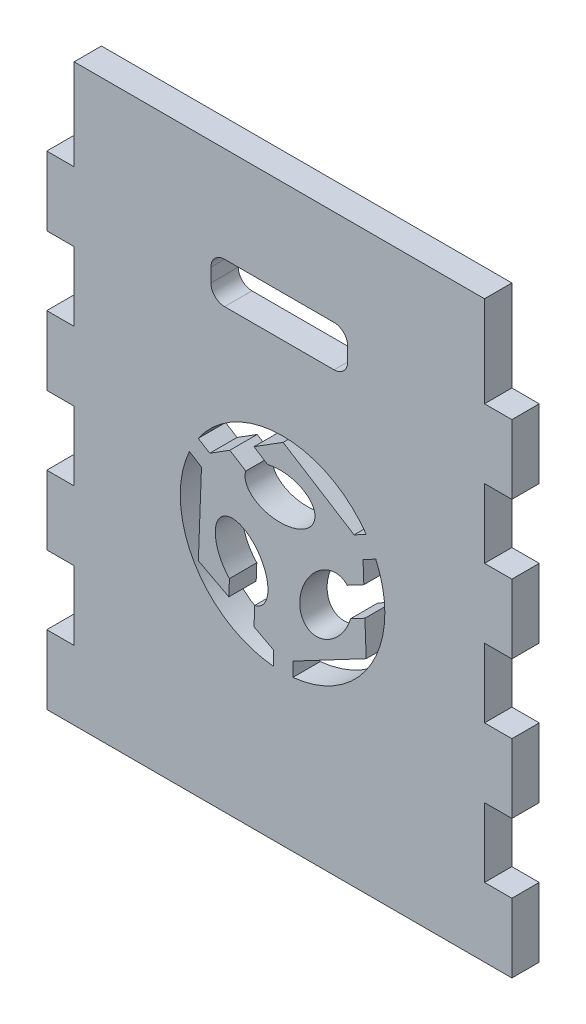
ISO-10303-21;
HEADER;
FILE_DESCRIPTION(('STEP AP214'),'2;1');
FILE_NAME('part.step','',(''),(''),'','','');
FILE_SCHEMA(('AUTOMOTIVE_DESIGN { 1 0 10303 214 1 1 1 1 }'));
ENDSEC;
DATA;
#1=APPLICATION_CONTEXT('core data for automotive mechanical design processes');
#2=APPLICATION_PROTOCOL_DEFINITION('international standard','automotive_design',2000,#1);
#3=PRODUCT_CONTEXT('',#1,'mechanical');
#4=PRODUCT('Part','Part','',(#3));
#5=PRODUCT_RELATED_PRODUCT_CATEGORY('part','',(#4));
#6=PRODUCT_DEFINITION_FORMATION('','',#4);
#7=PRODUCT_DEFINITION_CONTEXT('part definition',#1,'design');
#8=PRODUCT_DEFINITION('design','',#6,#7);
#9=PRODUCT_DEFINITION_SHAPE('','',#8);
#10=(LENGTH_UNIT() NAMED_UNIT(*) SI_UNIT(.MILLI.,.METRE.));
#11=(NAMED_UNIT(*) PLANE_ANGLE_UNIT() SI_UNIT($,.RADIAN.));
#12=(NAMED_UNIT(*) SI_UNIT($,.STERADIAN.) SOLID_ANGLE_UNIT());
#13=UNCERTAINTY_MEASURE_WITH_UNIT(LENGTH_MEASURE(1.E-05),#10,'distance_accuracy_value','');
#14=(GEOMETRIC_REPRESENTATION_CONTEXT(3) GLOBAL_UNCERTAINTY_ASSIGNED_CONTEXT((#13)) GLOBAL_UNIT_ASSIGNED_CONTEXT((#10,
#11,#12)) REPRESENTATION_CONTEXT('',''));
#15=CARTESIAN_POINT('',(0.,0.,0.));
#16=DIRECTION('',(0.,0.,1.));
#17=DIRECTION('',(1.,0.,0.));
#18=AXIS2_PLACEMENT_3D('',#15,#16,#17);
#19=CARTESIAN_POINT('',(336.832,46.75,20.));
#20=DIRECTION('',(-1.,0.,0.));
#21=DIRECTION('',(0.,0.,1.));
#22=AXIS2_PLACEMENT_3D('',#19,#20,#21);
#23=PLANE('',#22);
#24=DIRECTION('',(0.,1.,0.));
#25=VECTOR('',#24,1.);
#26=CARTESIAN_POINT('',(336.832,46.75,0.));
#27=LINE('',#26,#25);
#28=CARTESIAN_POINT('',(336.832,46.75,0.));
#29=VERTEX_POINT('',#28);
#30=CARTESIAN_POINT('',(336.832,97.2499999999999,0.));
#31=VERTEX_POINT('',#30);
#32=EDGE_CURVE('E856',#29,#31,#27,.T.);
#33=ORIENTED_EDGE('',*,*,#32,.T.);
#34=DIRECTION('',(0.,0.,-1.));
#35=VECTOR('',#34,1.);
#36=CARTESIAN_POINT('',(336.832,97.2499999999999,20.));
#37=LINE('',#36,#35);
#38=CARTESIAN_POINT('',(336.832,97.2499999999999,20.));
#39=VERTEX_POINT('',#38);
#40=EDGE_CURVE('E38',#39,#31,#37,.T.);
#41=ORIENTED_EDGE('',*,*,#40,.F.);
#42=DIRECTION('',(0.,1.,0.));
#43=VECTOR('',#42,1.);
#44=CARTESIAN_POINT('',(336.832,46.75,20.));
#45=LINE('',#44,#43);
#46=CARTESIAN_POINT('',(336.832,46.75,20.));
#47=VERTEX_POINT('',#46);
#48=EDGE_CURVE('E1101',#47,#39,#45,.T.);
#49=ORIENTED_EDGE('',*,*,#48,.F.);
#50=DIRECTION('',(0.,0.,-1.));
#51=VECTOR('',#50,1.);
#52=CARTESIAN_POINT('',(336.832,46.75,20.));
#53=LINE('',#52,#51);
#54=EDGE_CURVE('E11',#47,#29,#53,.T.);
#55=ORIENTED_EDGE('',*,*,#54,.T.);
#56=EDGE_LOOP('',(#33,#41,#49,#55));
#57=FACE_BOUND('',#56,.T.);
#58=ADVANCED_FACE('F31',(#57),#23,.F.);
#59=CARTESIAN_POINT('',(316.832,97.2499999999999,20.));
#60=DIRECTION('',(0.,-1.,0.));
#61=DIRECTION('',(0.,0.,-1.));
#62=AXIS2_PLACEMENT_3D('',#59,#60,#61);
#63=PLANE('',#62);
#64=DIRECTION('',(-1.,0.,0.));
#65=VECTOR('',#64,1.);
#66=CARTESIAN_POINT('',(316.832,97.2499999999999,0.));
#67=LINE('',#66,#65);
#68=CARTESIAN_POINT('',(316.832,97.2499999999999,0.));
#69=VERTEX_POINT('',#68);
#70=EDGE_CURVE('E846',#31,#69,#67,.T.);
#71=ORIENTED_EDGE('',*,*,#70,.T.);
#72=DIRECTION('',(0.,0.,-1.));
#73=VECTOR('',#72,1.);
#74=CARTESIAN_POINT('',(316.832,97.2499999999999,20.));
#75=LINE('',#74,#73);
#76=CARTESIAN_POINT('',(316.832,97.2499999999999,20.));
#77=VERTEX_POINT('',#76);
#78=EDGE_CURVE('E849',#77,#69,#75,.T.);
#79=ORIENTED_EDGE('',*,*,#78,.F.);
#80=DIRECTION('',(-1.,0.,0.));
#81=VECTOR('',#80,1.);
#82=CARTESIAN_POINT('',(316.832,97.2499999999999,20.));
#83=LINE('',#82,#81);
#84=EDGE_CURVE('E1021',#39,#77,#83,.T.);
#85=ORIENTED_EDGE('',*,*,#84,.F.);
#86=ORIENTED_EDGE('',*,*,#40,.T.);
#87=EDGE_LOOP('',(#71,#79,#85,#86));
#88=FACE_BOUND('',#87,.T.);
#89=ADVANCED_FACE('F835',(#88),#63,.F.);
#90=CARTESIAN_POINT('',(316.832,147.75,20.));
#91=DIRECTION('',(-1.,0.,0.));
#92=DIRECTION('',(0.,0.,1.));
#93=AXIS2_PLACEMENT_3D('',#90,#91,#92);
#94=PLANE('',#93);
#95=DIRECTION('',(0.,1.,0.));
#96=VECTOR('',#95,1.);
#97=CARTESIAN_POINT('',(316.832,147.75,0.));
#98=LINE('',#97,#96);
#99=CARTESIAN_POINT('',(316.832,147.75,0.));
#100=VERTEX_POINT('',#99);
#101=EDGE_CURVE('E855',#69,#100,#98,.T.);
#102=ORIENTED_EDGE('',*,*,#101,.T.);
#103=DIRECTION('',(0.,0.,-1.));
#104=VECTOR('',#103,1.);
#105=CARTESIAN_POINT('',(316.832,147.75,20.));
#106=LINE('',#105,#104);
#107=CARTESIAN_POINT('',(316.832,147.75,20.));
#108=VERTEX_POINT('',#107);
#109=EDGE_CURVE('E861',#108,#100,#106,.T.);
#110=ORIENTED_EDGE('',*,*,#109,.F.);
#111=DIRECTION('',(0.,1.,0.));
#112=VECTOR('',#111,1.);
#113=CARTESIAN_POINT('',(316.832,147.75,20.));
#114=LINE('',#113,#112);
#115=EDGE_CURVE('E860',#77,#108,#114,.T.);
#116=ORIENTED_EDGE('',*,*,#115,.F.);
#117=ORIENTED_EDGE('',*,*,#78,.T.);
#118=EDGE_LOOP('',(#102,#110,#116,#117));
#119=FACE_BOUND('',#118,.T.);
#120=ADVANCED_FACE('F832',(#119),#94,.F.);
#121=CARTESIAN_POINT('',(316.832,147.75,20.));
#122=DIRECTION('',(0.,1.,0.));
#123=DIRECTION('',(0.,0.,1.));
#124=AXIS2_PLACEMENT_3D('',#121,#122,#123);
#125=PLANE('',#124);
#126=DIRECTION('',(1.,0.,0.));
#127=VECTOR('',#126,1.);
#128=CARTESIAN_POINT('',(316.832,147.75,0.));
#129=LINE('',#128,#127);
#130=CARTESIAN_POINT('',(336.832,147.75,0.));
#131=VERTEX_POINT('',#130);
#132=EDGE_CURVE('E865',#100,#131,#129,.T.);
#133=ORIENTED_EDGE('',*,*,#132,.T.);
#134=DIRECTION('',(0.,0.,-1.));
#135=VECTOR('',#134,1.);
#136=CARTESIAN_POINT('',(336.832,147.75,20.));
#137=LINE('',#136,#135);
#138=CARTESIAN_POINT('',(336.832,147.75,20.));
#139=VERTEX_POINT('',#138);
#140=EDGE_CURVE('E1009',#139,#131,#137,.T.);
#141=ORIENTED_EDGE('',*,*,#140,.F.);
#142=DIRECTION('',(1.,0.,0.));
#143=VECTOR('',#142,1.);
#144=CARTESIAN_POINT('',(316.832,147.75,20.));
#145=LINE('',#144,#143);
#146=EDGE_CURVE('E1014',#108,#139,#145,.T.);
#147=ORIENTED_EDGE('',*,*,#146,.F.);
#148=ORIENTED_EDGE('',*,*,#109,.T.);
#149=EDGE_LOOP('',(#133,#141,#147,#148));
#150=FACE_BOUND('',#149,.T.);
#151=ADVANCED_FACE('F828',(#150),#125,.F.);
#152=CARTESIAN_POINT('',(336.832,147.75,20.));
#153=DIRECTION('',(-1.,0.,0.));
#154=DIRECTION('',(0.,0.,1.));
#155=AXIS2_PLACEMENT_3D('',#152,#153,#154);
#156=PLANE('',#155);
#157=DIRECTION('',(0.,1.,0.));
#158=VECTOR('',#157,1.);
#159=CARTESIAN_POINT('',(336.832,147.75,0.));
#160=LINE('',#159,#158);
#161=CARTESIAN_POINT('',(336.832,198.25,0.));
#162=VERTEX_POINT('',#161);
#163=EDGE_CURVE('E867',#131,#162,#160,.T.);
#164=ORIENTED_EDGE('',*,*,#163,.T.);
#165=DIRECTION('',(0.,0.,-1.));
#166=VECTOR('',#165,1.);
#167=CARTESIAN_POINT('',(336.832,198.25,20.));
#168=LINE('',#167,#166);
#169=CARTESIAN_POINT('',(336.832,198.25,20.));
#170=VERTEX_POINT('',#169);
#171=EDGE_CURVE('E1006',#170,#162,#168,.T.);
#172=ORIENTED_EDGE('',*,*,#171,.F.);
#173=DIRECTION('',(0.,1.,0.));
#174=VECTOR('',#173,1.);
#175=CARTESIAN_POINT('',(336.832,147.75,20.));
#176=LINE('',#175,#174);
#177=EDGE_CURVE('E1017',#139,#170,#176,.T.);
#178=ORIENTED_EDGE('',*,*,#177,.F.);
#179=ORIENTED_EDGE('',*,*,#140,.T.);
#180=EDGE_LOOP('',(#164,#172,#178,#179));
#181=FACE_BOUND('',#180,.T.);
#182=ADVANCED_FACE('F824',(#181),#156,.F.);
#183=CARTESIAN_POINT('',(316.832,198.25,20.));
#184=DIRECTION('',(0.,-1.,0.));
#185=DIRECTION('',(0.,0.,-1.));
#186=AXIS2_PLACEMENT_3D('',#183,#184,#185);
#187=PLANE('',#186);
#188=DIRECTION('',(-1.,0.,0.));
#189=VECTOR('',#188,1.);
#190=CARTESIAN_POINT('',(316.832,198.25,0.));
#191=LINE('',#190,#189);
#192=CARTESIAN_POINT('',(316.832,198.25,0.));
#193=VERTEX_POINT('',#192);
#194=EDGE_CURVE('E872',#162,#193,#191,.T.);
#195=ORIENTED_EDGE('',*,*,#194,.T.);
#196=DIRECTION('',(0.,0.,-1.));
#197=VECTOR('',#196,1.);
#198=CARTESIAN_POINT('',(316.832,198.25,20.));
#199=LINE('',#198,#197);
#200=CARTESIAN_POINT('',(316.832,198.25,20.));
#201=VERTEX_POINT('',#200);
#202=EDGE_CURVE('E1003',#201,#193,#199,.T.);
#203=ORIENTED_EDGE('',*,*,#202,.F.);
#204=DIRECTION('',(-1.,0.,0.));
#205=VECTOR('',#204,1.);
#206=CARTESIAN_POINT('',(316.832,198.25,20.));
#207=LINE('',#206,#205);
#208=EDGE_CURVE('E1019',#170,#201,#207,.T.);
#209=ORIENTED_EDGE('',*,*,#208,.F.);
#210=ORIENTED_EDGE('',*,*,#171,.T.);
#211=EDGE_LOOP('',(#195,#203,#209,#210));
#212=FACE_BOUND('',#211,.T.);
#213=ADVANCED_FACE('F820',(#212),#187,.F.);
#214=CARTESIAN_POINT('',(316.832,248.75,20.));
#215=DIRECTION('',(-1.,0.,0.));
#216=DIRECTION('',(0.,0.,1.));
#217=AXIS2_PLACEMENT_3D('',#214,#215,#216);
#218=PLANE('',#217);
#219=DIRECTION('',(0.,1.,0.));
#220=VECTOR('',#219,1.);
#221=CARTESIAN_POINT('',(316.832,248.75,0.));
#222=LINE('',#221,#220);
#223=CARTESIAN_POINT('',(316.832,248.75,0.));
#224=VERTEX_POINT('',#223);
#225=EDGE_CURVE('E874',#193,#224,#222,.T.);
#226=ORIENTED_EDGE('',*,*,#225,.T.);
#227=DIRECTION('',(0.,0.,-1.));
#228=VECTOR('',#227,1.);
#229=CARTESIAN_POINT('',(316.832,248.75,20.));
#230=LINE('',#229,#228);
#231=CARTESIAN_POINT('',(316.832,248.75,20.));
#232=VERTEX_POINT('',#231);
#233=EDGE_CURVE('E1000',#232,#224,#230,.T.);
#234=ORIENTED_EDGE('',*,*,#233,.F.);
#235=DIRECTION('',(0.,1.,0.));
#236=VECTOR('',#235,1.);
#237=CARTESIAN_POINT('',(316.832,248.75,20.));
#238=LINE('',#237,#236);
#239=EDGE_CURVE('E1026',#201,#232,#238,.T.);
#240=ORIENTED_EDGE('',*,*,#239,.F.);
#241=ORIENTED_EDGE('',*,*,#202,.T.);
#242=EDGE_LOOP('',(#226,#234,#240,#241));
#243=FACE_BOUND('',#242,.T.);
#244=ADVANCED_FACE('F816',(#243),#218,.F.);
#245=CARTESIAN_POINT('',(316.832,248.75,20.));
#246=DIRECTION('',(0.,1.,0.));
#247=DIRECTION('',(0.,0.,1.));
#248=AXIS2_PLACEMENT_3D('',#245,#246,#247);
#249=PLANE('',#248);
#250=DIRECTION('',(1.,0.,0.));
#251=VECTOR('',#250,1.);
#252=CARTESIAN_POINT('',(316.832,248.75,0.));
#253=LINE('',#252,#251);
#254=CARTESIAN_POINT('',(336.832,248.75,0.));
#255=VERTEX_POINT('',#254);
#256=EDGE_CURVE('E876',#224,#255,#253,.T.);
#257=ORIENTED_EDGE('',*,*,#256,.T.);
#258=DIRECTION('',(0.,0.,-1.));
#259=VECTOR('',#258,1.);
#260=CARTESIAN_POINT('',(336.832,248.75,20.));
#261=LINE('',#260,#259);
#262=CARTESIAN_POINT('',(336.832,248.75,20.));
#263=VERTEX_POINT('',#262);
#264=EDGE_CURVE('E997',#263,#255,#261,.T.);
#265=ORIENTED_EDGE('',*,*,#264,.F.);
#266=DIRECTION('',(1.,0.,0.));
#267=VECTOR('',#266,1.);
#268=CARTESIAN_POINT('',(316.832,248.75,20.));
#269=LINE('',#268,#267);
#270=EDGE_CURVE('E1028',#232,#263,#269,.T.);
#271=ORIENTED_EDGE('',*,*,#270,.F.);
#272=ORIENTED_EDGE('',*,*,#233,.T.);
#273=EDGE_LOOP('',(#257,#265,#271,#272));
#274=FACE_BOUND('',#273,.T.);
#275=ADVANCED_FACE('F812',(#274),#249,.F.);
#276=CARTESIAN_POINT('',(336.832,248.75,20.));
#277=DIRECTION('',(-1.,0.,0.));
#278=DIRECTION('',(0.,0.,1.));
#279=AXIS2_PLACEMENT_3D('',#276,#277,#278);
#280=PLANE('',#279);
#281=DIRECTION('',(0.,1.,0.));
#282=VECTOR('',#281,1.);
#283=CARTESIAN_POINT('',(336.832,248.75,0.));
#284=LINE('',#283,#282);
#285=CARTESIAN_POINT('',(336.832,299.25,0.));
#286=VERTEX_POINT('',#285);
#287=EDGE_CURVE('E878',#255,#286,#284,.T.);
#288=ORIENTED_EDGE('',*,*,#287,.T.);
#289=DIRECTION('',(0.,0.,-1.));
#290=VECTOR('',#289,1.);
#291=CARTESIAN_POINT('',(336.832,299.25,20.));
#292=LINE('',#291,#290);
#293=CARTESIAN_POINT('',(336.832,299.25,20.));
#294=VERTEX_POINT('',#293);
#295=EDGE_CURVE('E994',#294,#286,#292,.T.);
#296=ORIENTED_EDGE('',*,*,#295,.F.);
#297=DIRECTION('',(0.,1.,0.));
#298=VECTOR('',#297,1.);
#299=CARTESIAN_POINT('',(336.832,248.75,20.));
#300=LINE('',#299,#298);
#301=EDGE_CURVE('E1030',#263,#294,#300,.T.);
#302=ORIENTED_EDGE('',*,*,#301,.F.);
#303=ORIENTED_EDGE('',*,*,#264,.T.);
#304=EDGE_LOOP('',(#288,#296,#302,#303));
#305=FACE_BOUND('',#304,.T.);
#306=ADVANCED_FACE('F808',(#305),#280,.F.);
#307=CARTESIAN_POINT('',(316.832,299.25,20.));
#308=DIRECTION('',(0.,-1.,0.));
#309=DIRECTION('',(0.,0.,-1.));
#310=AXIS2_PLACEMENT_3D('',#307,#308,#309);
#311=PLANE('',#310);
#312=DIRECTION('',(-1.,0.,0.));
#313=VECTOR('',#312,1.);
#314=CARTESIAN_POINT('',(316.832,299.25,0.));
#315=LINE('',#314,#313);
#316=CARTESIAN_POINT('',(316.832,299.25,0.));
#317=VERTEX_POINT('',#316);
#318=EDGE_CURVE('E880',#286,#317,#315,.T.);
#319=ORIENTED_EDGE('',*,*,#318,.T.);
#320=DIRECTION('',(0.,0.,-1.));
#321=VECTOR('',#320,1.);
#322=CARTESIAN_POINT('',(316.832,299.25,20.));
#323=LINE('',#322,#321);
#324=CARTESIAN_POINT('',(316.832,299.25,20.));
#325=VERTEX_POINT('',#324);
#326=EDGE_CURVE('E991',#325,#317,#323,.T.);
#327=ORIENTED_EDGE('',*,*,#326,.F.);
#328=DIRECTION('',(-1.,0.,0.));
#329=VECTOR('',#328,1.);
#330=CARTESIAN_POINT('',(316.832,299.25,20.));
#331=LINE('',#330,#329);
#332=EDGE_CURVE('E1032',#294,#325,#331,.T.);
#333=ORIENTED_EDGE('',*,*,#332,.F.);
#334=ORIENTED_EDGE('',*,*,#295,.T.);
#335=EDGE_LOOP('',(#319,#327,#333,#334));
#336=FACE_BOUND('',#335,.T.);
#337=ADVANCED_FACE('F804',(#336),#311,.F.);
#338=CARTESIAN_POINT('',(316.832,349.75,20.));
#339=DIRECTION('',(-1.,0.,0.));
#340=DIRECTION('',(0.,0.,1.));
#341=AXIS2_PLACEMENT_3D('',#338,#339,#340);
#342=PLANE('',#341);
#343=DIRECTION('',(0.,1.,0.));
#344=VECTOR('',#343,1.);
#345=CARTESIAN_POINT('',(316.832,349.75,0.));
#346=LINE('',#345,#344);
#347=CARTESIAN_POINT('',(316.832,349.75,0.));
#348=VERTEX_POINT('',#347);
#349=EDGE_CURVE('E882',#317,#348,#346,.T.);
#350=ORIENTED_EDGE('',*,*,#349,.T.);
#351=DIRECTION('',(0.,0.,-1.));
#352=VECTOR('',#351,1.);
#353=CARTESIAN_POINT('',(316.832,349.75,20.));
#354=LINE('',#353,#352);
#355=CARTESIAN_POINT('',(316.832,349.75,20.));
#356=VERTEX_POINT('',#355);
#357=EDGE_CURVE('E988',#356,#348,#354,.T.);
#358=ORIENTED_EDGE('',*,*,#357,.F.);
#359=DIRECTION('',(0.,1.,0.));
#360=VECTOR('',#359,1.);
#361=CARTESIAN_POINT('',(316.832,349.75,20.));
#362=LINE('',#361,#360);
#363=EDGE_CURVE('E1034',#325,#356,#362,.T.);
#364=ORIENTED_EDGE('',*,*,#363,.F.);
#365=ORIENTED_EDGE('',*,*,#326,.T.);
#366=EDGE_LOOP('',(#350,#358,#364,#365));
#367=FACE_BOUND('',#366,.T.);
#368=ADVANCED_FACE('F800',(#367),#342,.F.);
#369=CARTESIAN_POINT('',(316.832,349.75,20.));
#370=DIRECTION('',(0.,1.,0.));
#371=DIRECTION('',(0.,0.,1.));
#372=AXIS2_PLACEMENT_3D('',#369,#370,#371);
#373=PLANE('',#372);
#374=DIRECTION('',(1.,0.,0.));
#375=VECTOR('',#374,1.);
#376=CARTESIAN_POINT('',(316.832,349.75,0.));
#377=LINE('',#376,#375);
#378=CARTESIAN_POINT('',(336.832,349.75,0.));
#379=VERTEX_POINT('',#378);
#380=EDGE_CURVE('E884',#348,#379,#377,.T.);
#381=ORIENTED_EDGE('',*,*,#380,.T.);
#382=DIRECTION('',(0.,0.,-1.));
#383=VECTOR('',#382,1.);
#384=CARTESIAN_POINT('',(336.832,349.75,20.));
#385=LINE('',#384,#383);
#386=CARTESIAN_POINT('',(336.832,349.75,20.));
#387=VERTEX_POINT('',#386);
#388=EDGE_CURVE('E985',#387,#379,#385,.T.);
#389=ORIENTED_EDGE('',*,*,#388,.F.);
#390=DIRECTION('',(1.,0.,0.));
#391=VECTOR('',#390,1.);
#392=CARTESIAN_POINT('',(316.832,349.75,20.));
#393=LINE('',#392,#391);
#394=EDGE_CURVE('E1036',#356,#387,#393,.T.);
#395=ORIENTED_EDGE('',*,*,#394,.F.);
#396=ORIENTED_EDGE('',*,*,#357,.T.);
#397=EDGE_LOOP('',(#381,#389,#395,#396));
#398=FACE_BOUND('',#397,.T.);
#399=ADVANCED_FACE('F796',(#398),#373,.F.);
#400=CARTESIAN_POINT('',(336.832,349.75,20.));
#401=DIRECTION('',(-1.,0.,0.));
#402=DIRECTION('',(0.,0.,1.));
#403=AXIS2_PLACEMENT_3D('',#400,#401,#402);
#404=PLANE('',#403);
#405=DIRECTION('',(0.,1.,0.));
#406=VECTOR('',#405,1.);
#407=CARTESIAN_POINT('',(336.832,349.75,0.));
#408=LINE('',#407,#406);
#409=CARTESIAN_POINT('',(336.832,400.25,0.));
#410=VERTEX_POINT('',#409);
#411=EDGE_CURVE('E886',#379,#410,#408,.T.);
#412=ORIENTED_EDGE('',*,*,#411,.T.);
#413=DIRECTION('',(0.,0.,-1.));
#414=VECTOR('',#413,1.);
#415=CARTESIAN_POINT('',(336.832,400.25,20.));
#416=LINE('',#415,#414);
#417=CARTESIAN_POINT('',(336.832,400.25,20.));
#418=VERTEX_POINT('',#417);
#419=EDGE_CURVE('E982',#418,#410,#416,.T.);
#420=ORIENTED_EDGE('',*,*,#419,.F.);
#421=DIRECTION('',(0.,1.,0.));
#422=VECTOR('',#421,1.);
#423=CARTESIAN_POINT('',(336.832,349.75,20.));
#424=LINE('',#423,#422);
#425=EDGE_CURVE('E1038',#387,#418,#424,.T.);
#426=ORIENTED_EDGE('',*,*,#425,.F.);
#427=ORIENTED_EDGE('',*,*,#388,.T.);
#428=EDGE_LOOP('',(#412,#420,#426,#427));
#429=FACE_BOUND('',#428,.T.);
#430=ADVANCED_FACE('F792',(#429),#404,.F.);
#431=CARTESIAN_POINT('',(316.832,400.25,20.));
#432=DIRECTION('',(0.,-1.,0.));
#433=DIRECTION('',(0.,0.,-1.));
#434=AXIS2_PLACEMENT_3D('',#431,#432,#433);
#435=PLANE('',#434);
#436=DIRECTION('',(-1.,0.,0.));
#437=VECTOR('',#436,1.);
#438=CARTESIAN_POINT('',(316.832,400.25,0.));
#439=LINE('',#438,#437);
#440=CARTESIAN_POINT('',(316.832,400.25,0.));
#441=VERTEX_POINT('',#440);
#442=EDGE_CURVE('E888',#410,#441,#439,.T.);
#443=ORIENTED_EDGE('',*,*,#442,.T.);
#444=DIRECTION('',(0.,0.,-1.));
#445=VECTOR('',#444,1.);
#446=CARTESIAN_POINT('',(316.832,400.25,20.));
#447=LINE('',#446,#445);
#448=CARTESIAN_POINT('',(316.832,400.25,20.));
#449=VERTEX_POINT('',#448);
#450=EDGE_CURVE('E979',#449,#441,#447,.T.);
#451=ORIENTED_EDGE('',*,*,#450,.F.);
#452=DIRECTION('',(-1.,0.,0.));
#453=VECTOR('',#452,1.);
#454=CARTESIAN_POINT('',(316.832,400.25,20.));
#455=LINE('',#454,#453);
#456=EDGE_CURVE('E1040',#418,#449,#455,.T.);
#457=ORIENTED_EDGE('',*,*,#456,.F.);
#458=ORIENTED_EDGE('',*,*,#419,.T.);
#459=EDGE_LOOP('',(#443,#451,#457,#458));
#460=FACE_BOUND('',#459,.T.);
#461=ADVANCED_FACE('F788',(#460),#435,.F.);
#462=CARTESIAN_POINT('',(316.832,466.75,20.));
#463=DIRECTION('',(-1.,0.,0.));
#464=DIRECTION('',(0.,0.,1.));
#465=AXIS2_PLACEMENT_3D('',#462,#463,#464);
#466=PLANE('',#465);
#467=DIRECTION('',(0.,1.,0.));
#468=VECTOR('',#467,1.);
#469=CARTESIAN_POINT('',(316.832,466.75,0.));
#470=LINE('',#469,#468);
#471=CARTESIAN_POINT('',(316.832,466.75,0.));
#472=VERTEX_POINT('',#471);
#473=EDGE_CURVE('E890',#441,#472,#470,.T.);
#474=ORIENTED_EDGE('',*,*,#473,.T.);
#475=DIRECTION('',(0.,0.,-1.));
#476=VECTOR('',#475,1.);
#477=CARTESIAN_POINT('',(316.832,466.75,20.));
#478=LINE('',#477,#476);
#479=CARTESIAN_POINT('',(316.832,466.75,20.));
#480=VERTEX_POINT('',#479);
#481=EDGE_CURVE('E976',#480,#472,#478,.T.);
#482=ORIENTED_EDGE('',*,*,#481,.F.);
#483=DIRECTION('',(0.,1.,0.));
#484=VECTOR('',#483,1.);
#485=CARTESIAN_POINT('',(316.832,466.75,20.));
#486=LINE('',#485,#484);
#487=EDGE_CURVE('E1042',#449,#480,#486,.T.);
#488=ORIENTED_EDGE('',*,*,#487,.F.);
#489=ORIENTED_EDGE('',*,*,#450,.T.);
#490=EDGE_LOOP('',(#474,#482,#488,#489));
#491=FACE_BOUND('',#490,.T.);
#492=ADVANCED_FACE('F784',(#491),#466,.F.);
#493=CARTESIAN_POINT('',(16.832,466.75,20.));
#494=DIRECTION('',(0.,-1.,0.));
#495=DIRECTION('',(0.,0.,-1.));
#496=AXIS2_PLACEMENT_3D('',#493,#494,#495);
#497=PLANE('',#496);
#498=DIRECTION('',(-1.,0.,0.));
#499=VECTOR('',#498,1.);
#500=CARTESIAN_POINT('',(16.832,466.75,0.));
#501=LINE('',#500,#499);
#502=CARTESIAN_POINT('',(16.832,466.75,0.));
#503=VERTEX_POINT('',#502);
#504=EDGE_CURVE('E892',#472,#503,#501,.T.);
#505=ORIENTED_EDGE('',*,*,#504,.T.);
#506=DIRECTION('',(0.,0.,-1.));
#507=VECTOR('',#506,1.);
#508=CARTESIAN_POINT('',(16.832,466.75,20.));
#509=LINE('',#508,#507);
#510=CARTESIAN_POINT('',(16.832,466.75,20.));
#511=VERTEX_POINT('',#510);
#512=EDGE_CURVE('E973',#511,#503,#509,.T.);
#513=ORIENTED_EDGE('',*,*,#512,.F.);
#514=DIRECTION('',(-1.,0.,0.));
#515=VECTOR('',#514,1.);
#516=CARTESIAN_POINT('',(16.832,466.75,20.));
#517=LINE('',#516,#515);
#518=EDGE_CURVE('E1044',#480,#511,#517,.T.);
#519=ORIENTED_EDGE('',*,*,#518,.F.);
#520=ORIENTED_EDGE('',*,*,#481,.T.);
#521=EDGE_LOOP('',(#505,#513,#519,#520));
#522=FACE_BOUND('',#521,.T.);
#523=ADVANCED_FACE('F780',(#522),#497,.F.);
#524=CARTESIAN_POINT('',(16.832,400.25,20.));
#525=DIRECTION('',(1.,0.,0.));
#526=DIRECTION('',(0.,0.,-1.));
#527=AXIS2_PLACEMENT_3D('',#524,#525,#526);
#528=PLANE('',#527);
#529=DIRECTION('',(0.,-1.,0.));
#530=VECTOR('',#529,1.);
#531=CARTESIAN_POINT('',(16.832,400.25,0.));
#532=LINE('',#531,#530);
#533=CARTESIAN_POINT('',(16.832,400.25,0.));
#534=VERTEX_POINT('',#533);
#535=EDGE_CURVE('E894',#503,#534,#532,.T.);
#536=ORIENTED_EDGE('',*,*,#535,.T.);
#537=DIRECTION('',(0.,0.,-1.));
#538=VECTOR('',#537,1.);
#539=CARTESIAN_POINT('',(16.832,400.25,20.));
#540=LINE('',#539,#538);
#541=CARTESIAN_POINT('',(16.832,400.25,20.));
#542=VERTEX_POINT('',#541);
#543=EDGE_CURVE('E970',#542,#534,#540,.T.);
#544=ORIENTED_EDGE('',*,*,#543,.F.);
#545=DIRECTION('',(0.,-1.,0.));
#546=VECTOR('',#545,1.);
#547=CARTESIAN_POINT('',(16.832,400.25,20.));
#548=LINE('',#547,#546);
#549=EDGE_CURVE('E1046',#511,#542,#548,.T.);
#550=ORIENTED_EDGE('',*,*,#549,.F.);
#551=ORIENTED_EDGE('',*,*,#512,.T.);
#552=EDGE_LOOP('',(#536,#544,#550,#551));
#553=FACE_BOUND('',#552,.T.);
#554=ADVANCED_FACE('F776',(#553),#528,.F.);
#555=CARTESIAN_POINT('',(-3.16800000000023,400.25,20.));
#556=DIRECTION('',(0.,-1.,0.));
#557=DIRECTION('',(0.,0.,-1.));
#558=AXIS2_PLACEMENT_3D('',#555,#556,#557);
#559=PLANE('',#558);
#560=DIRECTION('',(-1.,0.,0.));
#561=VECTOR('',#560,1.);
#562=CARTESIAN_POINT('',(-3.16800000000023,400.25,0.));
#563=LINE('',#562,#561);
#564=CARTESIAN_POINT('',(-3.16800000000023,400.25,0.));
#565=VERTEX_POINT('',#564);
#566=EDGE_CURVE('E896',#534,#565,#563,.T.);
#567=ORIENTED_EDGE('',*,*,#566,.T.);
#568=DIRECTION('',(0.,0.,-1.));
#569=VECTOR('',#568,1.);
#570=CARTESIAN_POINT('',(-3.16800000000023,400.25,20.));
#571=LINE('',#570,#569);
#572=CARTESIAN_POINT('',(-3.16800000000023,400.25,20.));
#573=VERTEX_POINT('',#572);
#574=EDGE_CURVE('E967',#573,#565,#571,.T.);
#575=ORIENTED_EDGE('',*,*,#574,.F.);
#576=DIRECTION('',(-1.,0.,0.));
#577=VECTOR('',#576,1.);
#578=CARTESIAN_POINT('',(-3.16800000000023,400.25,20.));
#579=LINE('',#578,#577);
#580=EDGE_CURVE('E1048',#542,#573,#579,.T.);
#581=ORIENTED_EDGE('',*,*,#580,.F.);
#582=ORIENTED_EDGE('',*,*,#543,.T.);
#583=EDGE_LOOP('',(#567,#575,#581,#582));
#584=FACE_BOUND('',#583,.T.);
#585=ADVANCED_FACE('F772',(#584),#559,.F.);
#586=CARTESIAN_POINT('',(-3.16800000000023,349.75,20.));
#587=DIRECTION('',(1.,0.,0.));
#588=DIRECTION('',(0.,0.,-1.));
#589=AXIS2_PLACEMENT_3D('',#586,#587,#588);
#590=PLANE('',#589);
#591=DIRECTION('',(0.,-1.,0.));
#592=VECTOR('',#591,1.);
#593=CARTESIAN_POINT('',(-3.16800000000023,349.75,0.));
#594=LINE('',#593,#592);
#595=CARTESIAN_POINT('',(-3.16800000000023,349.75,0.));
#596=VERTEX_POINT('',#595);
#597=EDGE_CURVE('E898',#565,#596,#594,.T.);
#598=ORIENTED_EDGE('',*,*,#597,.T.);
#599=DIRECTION('',(0.,0.,-1.));
#600=VECTOR('',#599,1.);
#601=CARTESIAN_POINT('',(-3.16800000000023,349.75,20.));
#602=LINE('',#601,#600);
#603=CARTESIAN_POINT('',(-3.16800000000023,349.75,20.));
#604=VERTEX_POINT('',#603);
#605=EDGE_CURVE('E964',#604,#596,#602,.T.);
#606=ORIENTED_EDGE('',*,*,#605,.F.);
#607=DIRECTION('',(0.,-1.,0.));
#608=VECTOR('',#607,1.);
#609=CARTESIAN_POINT('',(-3.16800000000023,349.75,20.));
#610=LINE('',#609,#608);
#611=EDGE_CURVE('E1050',#573,#604,#610,.T.);
#612=ORIENTED_EDGE('',*,*,#611,.F.);
#613=ORIENTED_EDGE('',*,*,#574,.T.);
#614=EDGE_LOOP('',(#598,#606,#612,#613));
#615=FACE_BOUND('',#614,.T.);
#616=ADVANCED_FACE('F768',(#615),#590,.F.);
#617=CARTESIAN_POINT('',(-3.16800000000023,349.75,20.));
#618=DIRECTION('',(0.,1.,0.));
#619=DIRECTION('',(0.,0.,1.));
#620=AXIS2_PLACEMENT_3D('',#617,#618,#619);
#621=PLANE('',#620);
#622=DIRECTION('',(1.,0.,0.));
#623=VECTOR('',#622,1.);
#624=CARTESIAN_POINT('',(-3.16800000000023,349.75,0.));
#625=LINE('',#624,#623);
#626=CARTESIAN_POINT('',(16.832,349.75,0.));
#627=VERTEX_POINT('',#626);
#628=EDGE_CURVE('E900',#596,#627,#625,.T.);
#629=ORIENTED_EDGE('',*,*,#628,.T.);
#630=DIRECTION('',(0.,0.,-1.));
#631=VECTOR('',#630,1.);
#632=CARTESIAN_POINT('',(16.832,349.75,20.));
#633=LINE('',#632,#631);
#634=CARTESIAN_POINT('',(16.832,349.75,20.));
#635=VERTEX_POINT('',#634);
#636=EDGE_CURVE('E961',#635,#627,#633,.T.);
#637=ORIENTED_EDGE('',*,*,#636,.F.);
#638=DIRECTION('',(1.,0.,0.));
#639=VECTOR('',#638,1.);
#640=CARTESIAN_POINT('',(-3.16800000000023,349.75,20.));
#641=LINE('',#640,#639);
#642=EDGE_CURVE('E1052',#604,#635,#641,.T.);
#643=ORIENTED_EDGE('',*,*,#642,.F.);
#644=ORIENTED_EDGE('',*,*,#605,.T.);
#645=EDGE_LOOP('',(#629,#637,#643,#644));
#646=FACE_BOUND('',#645,.T.);
#647=ADVANCED_FACE('F764',(#646),#621,.F.);
#648=CARTESIAN_POINT('',(16.832,299.25,20.));
#649=DIRECTION('',(1.,0.,0.));
#650=DIRECTION('',(0.,0.,-1.));
#651=AXIS2_PLACEMENT_3D('',#648,#649,#650);
#652=PLANE('',#651);
#653=DIRECTION('',(0.,-1.,0.));
#654=VECTOR('',#653,1.);
#655=CARTESIAN_POINT('',(16.832,299.25,0.));
#656=LINE('',#655,#654);
#657=CARTESIAN_POINT('',(16.832,299.25,0.));
#658=VERTEX_POINT('',#657);
#659=EDGE_CURVE('E902',#627,#658,#656,.T.);
#660=ORIENTED_EDGE('',*,*,#659,.T.);
#661=DIRECTION('',(0.,0.,-1.));
#662=VECTOR('',#661,1.);
#663=CARTESIAN_POINT('',(16.832,299.25,20.));
#664=LINE('',#663,#662);
#665=CARTESIAN_POINT('',(16.832,299.25,20.));
#666=VERTEX_POINT('',#665);
#667=EDGE_CURVE('E958',#666,#658,#664,.T.);
#668=ORIENTED_EDGE('',*,*,#667,.F.);
#669=DIRECTION('',(0.,-1.,0.));
#670=VECTOR('',#669,1.);
#671=CARTESIAN_POINT('',(16.832,299.25,20.));
#672=LINE('',#671,#670);
#673=EDGE_CURVE('E1054',#635,#666,#672,.T.);
#674=ORIENTED_EDGE('',*,*,#673,.F.);
#675=ORIENTED_EDGE('',*,*,#636,.T.);
#676=EDGE_LOOP('',(#660,#668,#674,#675));
#677=FACE_BOUND('',#676,.T.);
#678=ADVANCED_FACE('F760',(#677),#652,.F.);
#679=CARTESIAN_POINT('',(-3.16800000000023,299.25,20.));
#680=DIRECTION('',(0.,-1.,0.));
#681=DIRECTION('',(0.,0.,-1.));
#682=AXIS2_PLACEMENT_3D('',#679,#680,#681);
#683=PLANE('',#682);
#684=DIRECTION('',(-1.,0.,0.));
#685=VECTOR('',#684,1.);
#686=CARTESIAN_POINT('',(-3.16800000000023,299.25,0.));
#687=LINE('',#686,#685);
#688=CARTESIAN_POINT('',(-3.16800000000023,299.25,0.));
#689=VERTEX_POINT('',#688);
#690=EDGE_CURVE('E904',#658,#689,#687,.T.);
#691=ORIENTED_EDGE('',*,*,#690,.T.);
#692=DIRECTION('',(0.,0.,-1.));
#693=VECTOR('',#692,1.);
#694=CARTESIAN_POINT('',(-3.16800000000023,299.25,20.));
#695=LINE('',#694,#693);
#696=CARTESIAN_POINT('',(-3.16800000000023,299.25,20.));
#697=VERTEX_POINT('',#696);
#698=EDGE_CURVE('E955',#697,#689,#695,.T.);
#699=ORIENTED_EDGE('',*,*,#698,.F.);
#700=DIRECTION('',(-1.,0.,0.));
#701=VECTOR('',#700,1.);
#702=CARTESIAN_POINT('',(-3.16800000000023,299.25,20.));
#703=LINE('',#702,#701);
#704=EDGE_CURVE('E1056',#666,#697,#703,.T.);
#705=ORIENTED_EDGE('',*,*,#704,.F.);
#706=ORIENTED_EDGE('',*,*,#667,.T.);
#707=EDGE_LOOP('',(#691,#699,#705,#706));
#708=FACE_BOUND('',#707,.T.);
#709=ADVANCED_FACE('F756',(#708),#683,.F.);
#710=CARTESIAN_POINT('',(-3.16800000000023,248.75,20.));
#711=DIRECTION('',(1.,0.,0.));
#712=DIRECTION('',(0.,0.,-1.));
#713=AXIS2_PLACEMENT_3D('',#710,#711,#712);
#714=PLANE('',#713);
#715=DIRECTION('',(0.,-1.,0.));
#716=VECTOR('',#715,1.);
#717=CARTESIAN_POINT('',(-3.16800000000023,248.75,0.));
#718=LINE('',#717,#716);
#719=CARTESIAN_POINT('',(-3.16800000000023,248.75,0.));
#720=VERTEX_POINT('',#719);
#721=EDGE_CURVE('E906',#689,#720,#718,.T.);
#722=ORIENTED_EDGE('',*,*,#721,.T.);
#723=DIRECTION('',(0.,0.,-1.));
#724=VECTOR('',#723,1.);
#725=CARTESIAN_POINT('',(-3.16800000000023,248.75,20.));
#726=LINE('',#725,#724);
#727=CARTESIAN_POINT('',(-3.16800000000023,248.75,20.));
#728=VERTEX_POINT('',#727);
#729=EDGE_CURVE('E952',#728,#720,#726,.T.);
#730=ORIENTED_EDGE('',*,*,#729,.F.);
#731=DIRECTION('',(0.,-1.,0.));
#732=VECTOR('',#731,1.);
#733=CARTESIAN_POINT('',(-3.16800000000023,248.75,20.));
#734=LINE('',#733,#732);
#735=EDGE_CURVE('E1058',#697,#728,#734,.T.);
#736=ORIENTED_EDGE('',*,*,#735,.F.);
#737=ORIENTED_EDGE('',*,*,#698,.T.);
#738=EDGE_LOOP('',(#722,#730,#736,#737));
#739=FACE_BOUND('',#738,.T.);
#740=ADVANCED_FACE('F752',(#739),#714,.F.);
#741=CARTESIAN_POINT('',(-3.16800000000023,248.75,20.));
#742=DIRECTION('',(0.,1.,0.));
#743=DIRECTION('',(0.,0.,1.));
#744=AXIS2_PLACEMENT_3D('',#741,#742,#743);
#745=PLANE('',#744);
#746=DIRECTION('',(1.,0.,0.));
#747=VECTOR('',#746,1.);
#748=CARTESIAN_POINT('',(-3.16800000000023,248.75,0.));
#749=LINE('',#748,#747);
#750=CARTESIAN_POINT('',(16.832,248.75,0.));
#751=VERTEX_POINT('',#750);
#752=EDGE_CURVE('E908',#720,#751,#749,.T.);
#753=ORIENTED_EDGE('',*,*,#752,.T.);
#754=DIRECTION('',(0.,0.,-1.));
#755=VECTOR('',#754,1.);
#756=CARTESIAN_POINT('',(16.832,248.75,20.));
#757=LINE('',#756,#755);
#758=CARTESIAN_POINT('',(16.832,248.75,20.));
#759=VERTEX_POINT('',#758);
#760=EDGE_CURVE('E949',#759,#751,#757,.T.);
#761=ORIENTED_EDGE('',*,*,#760,.F.);
#762=DIRECTION('',(1.,0.,0.));
#763=VECTOR('',#762,1.);
#764=CARTESIAN_POINT('',(-3.16800000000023,248.75,20.));
#765=LINE('',#764,#763);
#766=EDGE_CURVE('E1060',#728,#759,#765,.T.);
#767=ORIENTED_EDGE('',*,*,#766,.F.);
#768=ORIENTED_EDGE('',*,*,#729,.T.);
#769=EDGE_LOOP('',(#753,#761,#767,#768));
#770=FACE_BOUND('',#769,.T.);
#771=ADVANCED_FACE('F748',(#770),#745,.F.);
#772=CARTESIAN_POINT('',(16.832,198.25,20.));
#773=DIRECTION('',(1.,0.,0.));
#774=DIRECTION('',(0.,0.,-1.));
#775=AXIS2_PLACEMENT_3D('',#772,#773,#774);
#776=PLANE('',#775);
#777=DIRECTION('',(0.,-1.,0.));
#778=VECTOR('',#777,1.);
#779=CARTESIAN_POINT('',(16.832,198.25,0.));
#780=LINE('',#779,#778);
#781=CARTESIAN_POINT('',(16.832,198.25,0.));
#782=VERTEX_POINT('',#781);
#783=EDGE_CURVE('E910',#751,#782,#780,.T.);
#784=ORIENTED_EDGE('',*,*,#783,.T.);
#785=DIRECTION('',(0.,0.,-1.));
#786=VECTOR('',#785,1.);
#787=CARTESIAN_POINT('',(16.832,198.25,20.));
#788=LINE('',#787,#786);
#789=CARTESIAN_POINT('',(16.832,198.25,20.));
#790=VERTEX_POINT('',#789);
#791=EDGE_CURVE('E946',#790,#782,#788,.T.);
#792=ORIENTED_EDGE('',*,*,#791,.F.);
#793=DIRECTION('',(0.,-1.,0.));
#794=VECTOR('',#793,1.);
#795=CARTESIAN_POINT('',(16.832,198.25,20.));
#796=LINE('',#795,#794);
#797=EDGE_CURVE('E1062',#759,#790,#796,.T.);
#798=ORIENTED_EDGE('',*,*,#797,.F.);
#799=ORIENTED_EDGE('',*,*,#760,.T.);
#800=EDGE_LOOP('',(#784,#792,#798,#799));
#801=FACE_BOUND('',#800,.T.);
#802=ADVANCED_FACE('F744',(#801),#776,.F.);
#803=CARTESIAN_POINT('',(-3.16800000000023,198.25,20.));
#804=DIRECTION('',(0.,-1.,0.));
#805=DIRECTION('',(0.,0.,-1.));
#806=AXIS2_PLACEMENT_3D('',#803,#804,#805);
#807=PLANE('',#806);
#808=DIRECTION('',(-1.,0.,0.));
#809=VECTOR('',#808,1.);
#810=CARTESIAN_POINT('',(-3.16800000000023,198.25,0.));
#811=LINE('',#810,#809);
#812=CARTESIAN_POINT('',(-3.16800000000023,198.25,0.));
#813=VERTEX_POINT('',#812);
#814=EDGE_CURVE('E912',#782,#813,#811,.T.);
#815=ORIENTED_EDGE('',*,*,#814,.T.);
#816=DIRECTION('',(0.,0.,-1.));
#817=VECTOR('',#816,1.);
#818=CARTESIAN_POINT('',(-3.16800000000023,198.25,20.));
#819=LINE('',#818,#817);
#820=CARTESIAN_POINT('',(-3.16800000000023,198.25,20.));
#821=VERTEX_POINT('',#820);
#822=EDGE_CURVE('E943',#821,#813,#819,.T.);
#823=ORIENTED_EDGE('',*,*,#822,.F.);
#824=DIRECTION('',(-1.,0.,0.));
#825=VECTOR('',#824,1.);
#826=CARTESIAN_POINT('',(-3.16800000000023,198.25,20.));
#827=LINE('',#826,#825);
#828=EDGE_CURVE('E1064',#790,#821,#827,.T.);
#829=ORIENTED_EDGE('',*,*,#828,.F.);
#830=ORIENTED_EDGE('',*,*,#791,.T.);
#831=EDGE_LOOP('',(#815,#823,#829,#830));
#832=FACE_BOUND('',#831,.T.);
#833=ADVANCED_FACE('F740',(#832),#807,.F.);
#834=CARTESIAN_POINT('',(-3.16800000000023,147.75,20.));
#835=DIRECTION('',(1.,0.,0.));
#836=DIRECTION('',(0.,0.,-1.));
#837=AXIS2_PLACEMENT_3D('',#834,#835,#836);
#838=PLANE('',#837);
#839=DIRECTION('',(0.,-1.,0.));
#840=VECTOR('',#839,1.);
#841=CARTESIAN_POINT('',(-3.16800000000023,147.75,0.));
#842=LINE('',#841,#840);
#843=CARTESIAN_POINT('',(-3.16800000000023,147.75,0.));
#844=VERTEX_POINT('',#843);
#845=EDGE_CURVE('E914',#813,#844,#842,.T.);
#846=ORIENTED_EDGE('',*,*,#845,.T.);
#847=DIRECTION('',(0.,0.,-1.));
#848=VECTOR('',#847,1.);
#849=CARTESIAN_POINT('',(-3.16800000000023,147.75,20.));
#850=LINE('',#849,#848);
#851=CARTESIAN_POINT('',(-3.16800000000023,147.75,20.));
#852=VERTEX_POINT('',#851);
#853=EDGE_CURVE('E940',#852,#844,#850,.T.);
#854=ORIENTED_EDGE('',*,*,#853,.F.);
#855=DIRECTION('',(0.,-1.,0.));
#856=VECTOR('',#855,1.);
#857=CARTESIAN_POINT('',(-3.16800000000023,147.75,20.));
#858=LINE('',#857,#856);
#859=EDGE_CURVE('E1066',#821,#852,#858,.T.);
#860=ORIENTED_EDGE('',*,*,#859,.F.);
#861=ORIENTED_EDGE('',*,*,#822,.T.);
#862=EDGE_LOOP('',(#846,#854,#860,#861));
#863=FACE_BOUND('',#862,.T.);
#864=ADVANCED_FACE('F736',(#863),#838,.F.);
#865=CARTESIAN_POINT('',(-3.16800000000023,147.75,20.));
#866=DIRECTION('',(0.,1.,0.));
#867=DIRECTION('',(0.,0.,1.));
#868=AXIS2_PLACEMENT_3D('',#865,#866,#867);
#869=PLANE('',#868);
#870=DIRECTION('',(1.,0.,0.));
#871=VECTOR('',#870,1.);
#872=CARTESIAN_POINT('',(-3.16800000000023,147.75,0.));
#873=LINE('',#872,#871);
#874=CARTESIAN_POINT('',(16.832,147.75,0.));
#875=VERTEX_POINT('',#874);
#876=EDGE_CURVE('E916',#844,#875,#873,.T.);
#877=ORIENTED_EDGE('',*,*,#876,.T.);
#878=DIRECTION('',(0.,0.,-1.));
#879=VECTOR('',#878,1.);
#880=CARTESIAN_POINT('',(16.832,147.75,20.));
#881=LINE('',#880,#879);
#882=CARTESIAN_POINT('',(16.832,147.75,20.));
#883=VERTEX_POINT('',#882);
#884=EDGE_CURVE('E937',#883,#875,#881,.T.);
#885=ORIENTED_EDGE('',*,*,#884,.F.);
#886=DIRECTION('',(1.,0.,0.));
#887=VECTOR('',#886,1.);
#888=CARTESIAN_POINT('',(-3.16800000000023,147.75,20.));
#889=LINE('',#888,#887);
#890=EDGE_CURVE('E1068',#852,#883,#889,.T.);
#891=ORIENTED_EDGE('',*,*,#890,.F.);
#892=ORIENTED_EDGE('',*,*,#853,.T.);
#893=EDGE_LOOP('',(#877,#885,#891,#892));
#894=FACE_BOUND('',#893,.T.);
#895=ADVANCED_FACE('F732',(#894),#869,.F.);
#896=CARTESIAN_POINT('',(16.832,97.2499999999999,20.));
#897=DIRECTION('',(1.,0.,0.));
#898=DIRECTION('',(0.,0.,-1.));
#899=AXIS2_PLACEMENT_3D('',#896,#897,#898);
#900=PLANE('',#899);
#901=DIRECTION('',(0.,-1.,0.));
#902=VECTOR('',#901,1.);
#903=CARTESIAN_POINT('',(16.832,97.2499999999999,0.));
#904=LINE('',#903,#902);
#905=CARTESIAN_POINT('',(16.832,97.2499999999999,0.));
#906=VERTEX_POINT('',#905);
#907=EDGE_CURVE('E918',#875,#906,#904,.T.);
#908=ORIENTED_EDGE('',*,*,#907,.T.);
#909=DIRECTION('',(0.,0.,-1.));
#910=VECTOR('',#909,1.);
#911=CARTESIAN_POINT('',(16.832,97.2499999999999,20.));
#912=LINE('',#911,#910);
#913=CARTESIAN_POINT('',(16.832,97.2499999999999,20.));
#914=VERTEX_POINT('',#913);
#915=EDGE_CURVE('E934',#914,#906,#912,.T.);
#916=ORIENTED_EDGE('',*,*,#915,.F.);
#917=DIRECTION('',(0.,-1.,0.));
#918=VECTOR('',#917,1.);
#919=CARTESIAN_POINT('',(16.832,97.2499999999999,20.));
#920=LINE('',#919,#918);
#921=EDGE_CURVE('E1070',#883,#914,#920,.T.);
#922=ORIENTED_EDGE('',*,*,#921,.F.);
#923=ORIENTED_EDGE('',*,*,#884,.T.);
#924=EDGE_LOOP('',(#908,#916,#922,#923));
#925=FACE_BOUND('',#924,.T.);
#926=ADVANCED_FACE('F728',(#925),#900,.F.);
#927=CARTESIAN_POINT('',(-3.16800000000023,97.2499999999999,20.));
#928=DIRECTION('',(0.,-1.,0.));
#929=DIRECTION('',(0.,0.,-1.));
#930=AXIS2_PLACEMENT_3D('',#927,#928,#929);
#931=PLANE('',#930);
#932=DIRECTION('',(-1.,0.,0.));
#933=VECTOR('',#932,1.);
#934=CARTESIAN_POINT('',(-3.16800000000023,97.2499999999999,0.));
#935=LINE('',#934,#933);
#936=CARTESIAN_POINT('',(-3.16800000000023,97.2499999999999,0.));
#937=VERTEX_POINT('',#936);
#938=EDGE_CURVE('E920',#906,#937,#935,.T.);
#939=ORIENTED_EDGE('',*,*,#938,.T.);
#940=DIRECTION('',(0.,0.,-1.));
#941=VECTOR('',#940,1.);
#942=CARTESIAN_POINT('',(-3.16800000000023,97.2499999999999,20.));
#943=LINE('',#942,#941);
#944=CARTESIAN_POINT('',(-3.16800000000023,97.2499999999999,20.));
#945=VERTEX_POINT('',#944);
#946=EDGE_CURVE('E930',#945,#937,#943,.T.);
#947=ORIENTED_EDGE('',*,*,#946,.F.);
#948=DIRECTION('',(-1.,0.,0.));
#949=VECTOR('',#948,1.);
#950=CARTESIAN_POINT('',(-3.16800000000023,97.2499999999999,20.));
#951=LINE('',#950,#949);
#952=EDGE_CURVE('E1072',#914,#945,#951,.T.);
#953=ORIENTED_EDGE('',*,*,#952,.F.);
#954=ORIENTED_EDGE('',*,*,#915,.T.);
#955=EDGE_LOOP('',(#939,#947,#953,#954));
#956=FACE_BOUND('',#955,.T.);
#957=ADVANCED_FACE('F724',(#956),#931,.F.);
#958=CARTESIAN_POINT('',(-3.16800000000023,46.75,20.));
#959=DIRECTION('',(1.,0.,0.));
#960=DIRECTION('',(0.,0.,-1.));
#961=AXIS2_PLACEMENT_3D('',#958,#959,#960);
#962=PLANE('',#961);
#963=DIRECTION('',(0.,-1.,0.));
#964=VECTOR('',#963,1.);
#965=CARTESIAN_POINT('',(-3.16800000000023,46.75,0.));
#966=LINE('',#965,#964);
#967=CARTESIAN_POINT('',(-3.16800000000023,46.75,0.));
#968=VERTEX_POINT('',#967);
#969=EDGE_CURVE('E922',#937,#968,#966,.T.);
#970=ORIENTED_EDGE('',*,*,#969,.T.);
#971=DIRECTION('',(0.,0.,-1.));
#972=VECTOR('',#971,1.);
#973=CARTESIAN_POINT('',(-3.16800000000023,46.75,20.));
#974=LINE('',#973,#972);
#975=CARTESIAN_POINT('',(-3.16800000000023,46.75,20.));
#976=VERTEX_POINT('',#975);
#977=EDGE_CURVE('E927',#976,#968,#974,.T.);
#978=ORIENTED_EDGE('',*,*,#977,.F.);
#979=DIRECTION('',(0.,-1.,0.));
#980=VECTOR('',#979,1.);
#981=CARTESIAN_POINT('',(-3.16800000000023,46.75,20.));
#982=LINE('',#981,#980);
#983=EDGE_CURVE('E931',#945,#976,#982,.T.);
#984=ORIENTED_EDGE('',*,*,#983,.F.);
#985=ORIENTED_EDGE('',*,*,#946,.T.);
#986=EDGE_LOOP('',(#970,#978,#984,#985));
#987=FACE_BOUND('',#986,.T.);
#988=ADVANCED_FACE('F720',(#987),#962,.F.);
#989=CARTESIAN_POINT('',(-3.16800000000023,46.75,20.));
#990=DIRECTION('',(0.,1.,0.));
#991=DIRECTION('',(0.,0.,1.));
#992=AXIS2_PLACEMENT_3D('',#989,#990,#991);
#993=PLANE('',#992);
#994=DIRECTION('',(1.,0.,0.));
#995=VECTOR('',#994,1.);
#996=CARTESIAN_POINT('',(-3.16800000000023,46.75,0.));
#997=LINE('',#996,#995);
#998=EDGE_CURVE('E924',#968,#29,#997,.T.);
#999=ORIENTED_EDGE('',*,*,#998,.T.);
#1000=ORIENTED_EDGE('',*,*,#54,.F.);
#1001=DIRECTION('',(1.,0.,0.));
#1002=VECTOR('',#1001,1.);
#1003=CARTESIAN_POINT('',(16.8319999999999,46.75,20.));
#1004=LINE('',#1003,#1002);
#1005=EDGE_CURVE('E926',#976,#47,#1004,.T.);
#1006=ORIENTED_EDGE('',*,*,#1005,.F.);
#1007=ORIENTED_EDGE('',*,*,#977,.T.);
#1008=EDGE_LOOP('',(#999,#1000,#1006,#1007));
#1009=FACE_BOUND('',#1008,.T.);
#1010=ADVANCED_FACE('F714',(#1009),#993,.F.);
#1011=CARTESIAN_POINT('',(336.832,46.75,20.));
#1012=DIRECTION('',(0.,0.,1.));
#1013=DIRECTION('',(1.,0.,0.));
#1014=AXIS2_PLACEMENT_3D('',#1011,#1012,#1013);
#1015=PLANE('',#1014);
#1016=CARTESIAN_POINT('',(126.832,386.75,20.));
#1017=DIRECTION('',(0.,0.,1.));
#1018=DIRECTION('',(1.,0.,0.));
#1019=AXIS2_PLACEMENT_3D('',#1016,#1017,#1018);
#1020=CIRCLE('',#1019,10.);
#1021=CARTESIAN_POINT('',(126.832,396.75,20.));
#1022=VERTEX_POINT('',#1021);
#1023=CARTESIAN_POINT('',(116.832,386.75,20.));
#1024=VERTEX_POINT('',#1023);
#1025=EDGE_CURVE('E45',#1022,#1024,#1020,.T.);
#1026=ORIENTED_EDGE('',*,*,#1025,.F.);
#1027=DIRECTION('',(-1.,0.,0.));
#1028=VECTOR('',#1027,1.);
#1029=CARTESIAN_POINT('',(126.832,396.75,20.));
#1030=LINE('',#1029,#1028);
#1031=CARTESIAN_POINT('',(206.832,396.75,20.));
#1032=VERTEX_POINT('',#1031);
#1033=EDGE_CURVE('E468',#1032,#1022,#1030,.T.);
#1034=ORIENTED_EDGE('',*,*,#1033,.F.);
#1035=CARTESIAN_POINT('',(206.832,386.75,20.));
#1036=DIRECTION('',(0.,0.,1.));
#1037=DIRECTION('',(-1.,0.,0.));
#1038=AXIS2_PLACEMENT_3D('',#1035,#1036,#1037);
#1039=CIRCLE('',#1038,9.99999999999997);
#1040=CARTESIAN_POINT('',(216.832,386.75,20.));
#1041=VERTEX_POINT('',#1040);
#1042=EDGE_CURVE('E471',#1041,#1032,#1039,.T.);
#1043=ORIENTED_EDGE('',*,*,#1042,.F.);
#1044=DIRECTION('',(0.,1.,0.));
#1045=VECTOR('',#1044,1.);
#1046=CARTESIAN_POINT('',(216.832,386.75,20.));
#1047=LINE('',#1046,#1045);
#1048=CARTESIAN_POINT('',(216.832,376.75,20.));
#1049=VERTEX_POINT('',#1048);
#1050=EDGE_CURVE('E499',#1049,#1041,#1047,.T.);
#1051=ORIENTED_EDGE('',*,*,#1050,.F.);
#1052=CARTESIAN_POINT('',(206.832,376.75,20.));
#1053=DIRECTION('',(0.,0.,1.));
#1054=DIRECTION('',(-1.,0.,0.));
#1055=AXIS2_PLACEMENT_3D('',#1052,#1053,#1054);
#1056=CIRCLE('',#1055,10.);
#1057=CARTESIAN_POINT('',(206.832,366.75,20.));
#1058=VERTEX_POINT('',#1057);
#1059=EDGE_CURVE('E496',#1058,#1049,#1056,.T.);
#1060=ORIENTED_EDGE('',*,*,#1059,.F.);
#1061=DIRECTION('',(1.,0.,0.));
#1062=VECTOR('',#1061,1.);
#1063=CARTESIAN_POINT('',(126.832,366.75,20.));
#1064=LINE('',#1063,#1062);
#1065=CARTESIAN_POINT('',(126.832,366.75,20.));
#1066=VERTEX_POINT('',#1065);
#1067=EDGE_CURVE('E493',#1066,#1058,#1064,.T.);
#1068=ORIENTED_EDGE('',*,*,#1067,.F.);
#1069=CARTESIAN_POINT('',(126.832,376.75,20.));
#1070=DIRECTION('',(0.,0.,1.));
#1071=DIRECTION('',(-1.,0.,0.));
#1072=AXIS2_PLACEMENT_3D('',#1069,#1070,#1071);
#1073=CIRCLE('',#1072,10.);
#1074=CARTESIAN_POINT('',(116.832,376.75,20.));
#1075=VERTEX_POINT('',#1074);
#1076=EDGE_CURVE('E490',#1075,#1066,#1073,.T.);
#1077=ORIENTED_EDGE('',*,*,#1076,.F.);
#1078=DIRECTION('',(0.,-1.,0.));
#1079=VECTOR('',#1078,1.);
#1080=CARTESIAN_POINT('',(116.832,386.75,20.));
#1081=LINE('',#1080,#1079);
#1082=EDGE_CURVE('E488',#1024,#1075,#1081,.T.);
#1083=ORIENTED_EDGE('',*,*,#1082,.F.);
#1084=EDGE_LOOP('',(#1026,#1034,#1043,#1051,#1060,#1068,#1077,#1083));
#1085=FACE_BOUND('',#1084,.T.);
#1086=CARTESIAN_POINT('',(169.197486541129,231.3969584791,20.));
#1087=DIRECTION('',(0.,0.,1.));
#1088=DIRECTION('',(1.,0.,0.));
#1089=AXIS2_PLACEMENT_3D('',#1086,#1087,#1088);
#1090=CIRCLE('',#1089,74.7732123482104);
#1091=CARTESIAN_POINT('',(176.734635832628,157.004588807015,20.));
#1092=VERTEX_POINT('',#1091);
#1093=CARTESIAN_POINT('',(237.346932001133,262.165227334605,20.));
#1094=VERTEX_POINT('',#1093);
#1095=EDGE_CURVE('E506',#1092,#1094,#1090,.T.);
#1096=ORIENTED_EDGE('',*,*,#1095,.F.);
#1097=DIRECTION('',(-2.36856100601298E-13,-1.,0.));
#1098=VECTOR('',#1097,1.);
#1099=CARTESIAN_POINT('',(176.73463583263,167.316717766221,20.));
#1100=LINE('',#1099,#1098);
#1101=CARTESIAN_POINT('',(176.73463583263,167.316717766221,20.));
#1102=VERTEX_POINT('',#1101);
#1103=EDGE_CURVE('E522',#1102,#1092,#1100,.T.);
#1104=ORIENTED_EDGE('',*,*,#1103,.F.);
#1105=DIRECTION('',(-0.884213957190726,-0.467082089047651,0.));
#1106=VECTOR('',#1105,1.);
#1107=CARTESIAN_POINT('',(230.341916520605,195.634525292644,20.));
#1108=LINE('',#1107,#1106);
#1109=CARTESIAN_POINT('',(230.341916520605,195.634525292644,20.));
#1110=VERTEX_POINT('',#1109);
#1111=EDGE_CURVE('E1286',#1110,#1102,#1108,.T.);
#1112=ORIENTED_EDGE('',*,*,#1111,.F.);
#1113=DIRECTION('',(0.0376020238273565,-0.999292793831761,0.));
#1114=VECTOR('',#1113,1.);
#1115=CARTESIAN_POINT('',(229.395063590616,220.797620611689,20.));
#1116=LINE('',#1115,#1114);
#1117=CARTESIAN_POINT('',(229.395063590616,220.797620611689,20.));
#1118=VERTEX_POINT('',#1117);
#1119=EDGE_CURVE('E1289',#1118,#1110,#1116,.T.);
#1120=ORIENTED_EDGE('',*,*,#1119,.F.);
#1121=DIRECTION('',(0.884213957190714,0.467082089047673,0.));
#1122=VECTOR('',#1121,1.);
#1123=CARTESIAN_POINT('',(218.937196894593,215.273299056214,20.));
#1124=LINE('',#1123,#1122);
#1125=CARTESIAN_POINT('',(218.937196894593,215.273299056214,20.));
#1126=VERTEX_POINT('',#1125);
#1127=EDGE_CURVE('E1292',#1126,#1118,#1124,.T.);
#1128=ORIENTED_EDGE('',*,*,#1127,.F.);
#1129=CARTESIAN_POINT('',(200.981173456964,215.195724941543,20.));
#1130=DIRECTION('',(0.,0.,1.));
#1131=DIRECTION('',(-0.500000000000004,-0.866025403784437,0.));
#1132=AXIS2_PLACEMENT_3D('',#1129,#1130,#1131);
#1133=ELLIPSE('',#1132,25.5671719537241,16.5841115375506);
#1134=CARTESIAN_POINT('',(216.437455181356,235.167502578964,20.));
#1135=VERTEX_POINT('',#1134);
#1136=EDGE_CURVE('E1295',#1135,#1126,#1133,.T.);
#1137=ORIENTED_EDGE('',*,*,#1136,.F.);
#1138=DIRECTION('',(-0.88421395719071,-0.46708208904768,0.));
#1139=VECTOR('',#1138,1.);
#1140=CARTESIAN_POINT('',(228.612342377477,241.598832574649,20.));
#1141=LINE('',#1140,#1139);
#1142=CARTESIAN_POINT('',(228.612342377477,241.598832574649,20.));
#1143=VERTEX_POINT('',#1142);
#1144=EDGE_CURVE('E1298',#1143,#1135,#1141,.T.);
#1145=ORIENTED_EDGE('',*,*,#1144,.F.);
#1146=DIRECTION('',(0.0376020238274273,-0.999292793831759,0.));
#1147=VECTOR('',#1146,1.);
#1148=CARTESIAN_POINT('',(228.023774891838,257.24031107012,20.));
#1149=LINE('',#1148,#1147);
#1150=CARTESIAN_POINT('',(228.023774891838,257.24031107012,20.));
#1151=VERTEX_POINT('',#1150);
#1152=EDGE_CURVE('E1301',#1151,#1143,#1149,.T.);
#1153=ORIENTED_EDGE('',*,*,#1152,.F.);
#1154=DIRECTION('',(-0.88421395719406,-0.467082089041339,0.));
#1155=VECTOR('',#1154,1.);
#1156=CARTESIAN_POINT('',(228.023774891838,257.24031107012,20.));
#1157=LINE('',#1156,#1155);
#1158=EDGE_CURVE('E1304',#1094,#1151,#1157,.T.);
#1159=ORIENTED_EDGE('',*,*,#1158,.F.);
#1160=EDGE_LOOP('',(#1096,#1104,#1112,#1120,#1128,#1137,#1145,#1153,#1159));
#1161=FACE_BOUND('',#1160,.T.);
#1162=DIRECTION('',(0.846611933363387,0.532210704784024,0.));
#1163=VECTOR('',#1162,1.);
#1164=CARTESIAN_POINT('',(115.94116868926,268.50116726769,20.));
#1165=LINE('',#1164,#1163);
#1166=CARTESIAN_POINT('',(115.94116868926,268.50116726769,20.));
#1167=VERTEX_POINT('',#1166);
#1168=CARTESIAN_POINT('',(130.654976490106,277.75079594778,20.));
#1169=VERTEX_POINT('',#1168);
#1170=EDGE_CURVE('E620',#1167,#1169,#1165,.T.);
#1171=ORIENTED_EDGE('',*,*,#1170,.F.);
#1172=DIRECTION('',(0.846611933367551,-0.532210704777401,0.));
#1173=VECTOR('',#1172,1.);
#1174=CARTESIAN_POINT('',(107.580452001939,273.757014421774,20.));
#1175=LINE('',#1174,#1173);
#1176=CARTESIAN_POINT('',(107.580452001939,273.757014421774,20.));
#1177=VERTEX_POINT('',#1176);
#1178=EDGE_CURVE('E644',#1177,#1167,#1175,.T.);
#1179=ORIENTED_EDGE('',*,*,#1178,.F.);
#1180=CARTESIAN_POINT('',(169.197486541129,231.3969584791,20.));
#1181=DIRECTION('',(0.,0.,1.));
#1182=DIRECTION('',(1.,0.,0.));
#1183=AXIS2_PLACEMENT_3D('',#1180,#1181,#1182);
#1184=CIRCLE('',#1183,74.7732123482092);
#1185=CARTESIAN_POINT('',(230.419866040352,274.325428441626,20.));
#1186=VERTEX_POINT('',#1185);
#1187=EDGE_CURVE('E641',#1186,#1177,#1184,.T.);
#1188=ORIENTED_EDGE('',*,*,#1187,.F.);
#1189=DIRECTION('',(0.884213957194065,0.467082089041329,0.));
#1190=VECTOR('',#1189,1.);
#1191=CARTESIAN_POINT('',(221.490332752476,269.608442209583,20.));
#1192=LINE('',#1191,#1190);
#1193=CARTESIAN_POINT('',(221.490332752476,269.608442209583,20.));
#1194=VERTEX_POINT('',#1193);
#1195=EDGE_CURVE('E638',#1194,#1186,#1192,.T.);
#1196=ORIENTED_EDGE('',*,*,#1195,.F.);
#1197=DIRECTION('',(0.846611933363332,-0.532210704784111,0.));
#1198=VECTOR('',#1197,1.);
#1199=CARTESIAN_POINT('',(169.596447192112,302.230804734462,20.));
#1200=LINE('',#1199,#1198);
#1201=CARTESIAN_POINT('',(169.596447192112,302.230804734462,20.));
#1202=VERTEX_POINT('',#1201);
#1203=EDGE_CURVE('E635',#1202,#1194,#1200,.T.);
#1204=ORIENTED_EDGE('',*,*,#1203,.F.);
#1205=DIRECTION('',(0.84661193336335,0.532210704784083,0.));
#1206=VECTOR('',#1205,1.);
#1207=CARTESIAN_POINT('',(148.277993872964,288.82925838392,20.));
#1208=LINE('',#1207,#1206);
#1209=CARTESIAN_POINT('',(148.277993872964,288.82925838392,20.));
#1210=VERTEX_POINT('',#1209);
#1211=EDGE_CURVE('E632',#1210,#1202,#1208,.T.);
#1212=ORIENTED_EDGE('',*,*,#1211,.F.);
#1213=DIRECTION('',(-0.846611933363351,0.532210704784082,0.));
#1214=VECTOR('',#1213,1.);
#1215=CARTESIAN_POINT('',(158.291130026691,282.534640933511,20.));
#1216=LINE('',#1215,#1214);
#1217=CARTESIAN_POINT('',(158.291130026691,282.534640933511,20.));
#1218=VERTEX_POINT('',#1217);
#1219=EDGE_CURVE('E629',#1218,#1210,#1216,.T.);
#1220=ORIENTED_EDGE('',*,*,#1219,.F.);
#1221=CARTESIAN_POINT('',(167.336322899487,267.023055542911,20.));
#1222=DIRECTION('',(0.,0.,1.));
#1223=DIRECTION('',(1.,0.,0.));
#1224=AXIS2_PLACEMENT_3D('',#1221,#1222,#1223);
#1225=ELLIPSE('',#1224,25.567171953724,16.5841115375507);
#1226=CARTESIAN_POINT('',(142.31211524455,270.422699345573,20.));
#1227=VERTEX_POINT('',#1226);
#1228=EDGE_CURVE('E626',#1227,#1218,#1225,.T.);
#1229=ORIENTED_EDGE('',*,*,#1228,.F.);
#1230=DIRECTION('',(0.84661193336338,-0.532210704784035,0.));
#1231=VECTOR('',#1230,1.);
#1232=CARTESIAN_POINT('',(130.654976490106,277.75079594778,20.));
#1233=LINE('',#1232,#1231);
#1234=EDGE_CURVE('E622',#1169,#1227,#1233,.T.);
#1235=ORIENTED_EDGE('',*,*,#1234,.F.);
#1236=EDGE_LOOP('',(#1171,#1179,#1188,#1196,#1204,#1212,#1220,#1229,#1235));
#1237=FACE_BOUND('',#1236,.T.);
#1238=CARTESIAN_POINT('',(169.197486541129,231.3969584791,20.));
#1239=DIRECTION('',(0.,0.,1.));
#1240=DIRECTION('',(1.,0.,0.));
#1241=AXIS2_PLACEMENT_3D('',#1238,#1239,#1240);
#1242=CIRCLE('',#1241,74.7732123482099);
#1243=CARTESIAN_POINT('',(101.090384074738,262.258842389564,20.));
#1244=VERTEX_POINT('',#1243);
#1245=CARTESIAN_POINT('',(162.484487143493,156.925696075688,20.));
#1246=VERTEX_POINT('',#1245);
#1247=EDGE_CURVE('E650',#1244,#1246,#1242,.T.);
#1248=ORIENTED_EDGE('',*,*,#1247,.F.);
#1249=DIRECTION('',(-0.846611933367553,0.532210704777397,0.));
#1250=VECTOR('',#1249,1.);
#1251=CARTESIAN_POINT('',(101.090384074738,262.258842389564,20.));
#1252=LINE('',#1251,#1250);
#1253=CARTESIAN_POINT('',(109.926070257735,256.70441233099,20.));
#1254=VERTEX_POINT('',#1253);
#1255=EDGE_CURVE('E671',#1254,#1244,#1252,.T.);
#1256=ORIENTED_EDGE('',*,*,#1255,.F.);
#1257=DIRECTION('',(0.0376020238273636,0.999292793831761,0.));
#1258=VECTOR('',#1257,1.);
#1259=CARTESIAN_POINT('',(107.65409591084,196.325545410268,20.));
#1260=LINE('',#1259,#1258);
#1261=CARTESIAN_POINT('',(107.65409591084,196.325545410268,20.));
#1262=VERTEX_POINT('',#1261);
#1263=EDGE_CURVE('E1213',#1262,#1254,#1260,.T.);
#1264=ORIENTED_EDGE('',*,*,#1263,.F.);
#1265=DIRECTION('',(-0.88421395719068,0.467082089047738,0.));
#1266=VECTOR('',#1265,1.);
#1267=CARTESIAN_POINT('',(129.919402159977,184.563996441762,20.));
#1268=LINE('',#1267,#1266);
#1269=CARTESIAN_POINT('',(129.919402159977,184.563996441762,20.));
#1270=VERTEX_POINT('',#1269);
#1271=EDGE_CURVE('E1211',#1270,#1262,#1268,.T.);
#1272=ORIENTED_EDGE('',*,*,#1271,.F.);
#1273=DIRECTION('',(-0.0376020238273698,-0.999292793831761,0.));
#1274=VECTOR('',#1273,1.);
#1275=CARTESIAN_POINT('',(130.364132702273,196.38293544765,20.));
#1276=LINE('',#1275,#1274);
#1277=CARTESIAN_POINT('',(130.364132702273,196.38293544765,20.));
#1278=VERTEX_POINT('',#1277);
#1279=EDGE_CURVE('E1208',#1278,#1270,#1276,.T.);
#1280=ORIENTED_EDGE('',*,*,#1279,.F.);
#1281=CARTESIAN_POINT('',(139.274963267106,211.972094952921,20.));
#1282=DIRECTION('',(0.,0.,1.));
#1283=DIRECTION('',(-0.499999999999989,0.866025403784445,0.));
#1284=AXIS2_PLACEMENT_3D('',#1281,#1282,#1283);
#1285=ELLIPSE('',#1284,25.567171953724,16.5841115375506);
#1286=CARTESIAN_POINT('',(148.84288919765,188.600673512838,20.));
#1287=VERTEX_POINT('',#1286);
#1288=EDGE_CURVE('E1205',#1287,#1278,#1285,.T.);
#1289=ORIENTED_EDGE('',*,*,#1288,.F.);
#1290=DIRECTION('',(0.0376020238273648,0.999292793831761,0.));
#1291=VECTOR('',#1290,1.);
#1292=CARTESIAN_POINT('',(148.325140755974,174.841246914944,20.));
#1293=LINE('',#1292,#1291);
#1294=CARTESIAN_POINT('',(148.325140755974,174.841246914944,20.));
#1295=VERTEX_POINT('',#1294);
#1296=EDGE_CURVE('E1202',#1295,#1287,#1293,.T.);
#1297=ORIENTED_EDGE('',*,*,#1296,.F.);
#1298=DIRECTION('',(-0.884213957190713,0.467082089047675,0.));
#1299=VECTOR('',#1298,1.);
#1300=CARTESIAN_POINT('',(162.484487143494,167.361635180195,20.));
#1301=LINE('',#1300,#1299);
#1302=CARTESIAN_POINT('',(162.484487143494,167.361635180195,20.));
#1303=VERTEX_POINT('',#1302);
#1304=EDGE_CURVE('E1199',#1303,#1295,#1301,.T.);
#1305=ORIENTED_EDGE('',*,*,#1304,.F.);
#1306=DIRECTION('',(0.,1.,0.));
#1307=VECTOR('',#1306,1.);
#1308=CARTESIAN_POINT('',(162.484487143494,167.361635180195,20.));
#1309=LINE('',#1308,#1307);
#1310=EDGE_CURVE('E1197',#1246,#1303,#1309,.T.);
#1311=ORIENTED_EDGE('',*,*,#1310,.F.);
#1312=EDGE_LOOP('',(#1248,#1256,#1264,#1272,#1280,#1289,#1297,#1305,#1311));
#1313=FACE_BOUND('',#1312,.T.);
#1314=ORIENTED_EDGE('',*,*,#1005,.T.);
#1315=ORIENTED_EDGE('',*,*,#48,.T.);
#1316=ORIENTED_EDGE('',*,*,#84,.T.);
#1317=ORIENTED_EDGE('',*,*,#115,.T.);
#1318=ORIENTED_EDGE('',*,*,#146,.T.);
#1319=ORIENTED_EDGE('',*,*,#177,.T.);
#1320=ORIENTED_EDGE('',*,*,#208,.T.);
#1321=ORIENTED_EDGE('',*,*,#239,.T.);
#1322=ORIENTED_EDGE('',*,*,#270,.T.);
#1323=ORIENTED_EDGE('',*,*,#301,.T.);
#1324=ORIENTED_EDGE('',*,*,#332,.T.);
#1325=ORIENTED_EDGE('',*,*,#363,.T.);
#1326=ORIENTED_EDGE('',*,*,#394,.T.);
#1327=ORIENTED_EDGE('',*,*,#425,.T.);
#1328=ORIENTED_EDGE('',*,*,#456,.T.);
#1329=ORIENTED_EDGE('',*,*,#487,.T.);
#1330=ORIENTED_EDGE('',*,*,#518,.T.);
#1331=ORIENTED_EDGE('',*,*,#549,.T.);
#1332=ORIENTED_EDGE('',*,*,#580,.T.);
#1333=ORIENTED_EDGE('',*,*,#611,.T.);
#1334=ORIENTED_EDGE('',*,*,#642,.T.);
#1335=ORIENTED_EDGE('',*,*,#673,.T.);
#1336=ORIENTED_EDGE('',*,*,#704,.T.);
#1337=ORIENTED_EDGE('',*,*,#735,.T.);
#1338=ORIENTED_EDGE('',*,*,#766,.T.);
#1339=ORIENTED_EDGE('',*,*,#797,.T.);
#1340=ORIENTED_EDGE('',*,*,#828,.T.);
#1341=ORIENTED_EDGE('',*,*,#859,.T.);
#1342=ORIENTED_EDGE('',*,*,#890,.T.);
#1343=ORIENTED_EDGE('',*,*,#921,.T.);
#1344=ORIENTED_EDGE('',*,*,#952,.T.);
#1345=ORIENTED_EDGE('',*,*,#983,.T.);
#1346=EDGE_LOOP('',(#1314,#1315,#1316,#1317,#1318,#1319,#1320,#1321,#1322,#1323,#1324,#1325,
#1326,#1327,#1328,#1329,#1330,#1331,#1332,#1333,#1334,#1335,#1336,#1337,#1338,#1339,#1340,#1341,
#1342,#1343,#1344,#1345));
#1347=FACE_BOUND('',#1346,.T.);
#1348=ADVANCED_FACE('F711',(#1085,#1161,#1237,#1313,#1347),#1015,.T.);
#1349=CARTESIAN_POINT('',(336.832,46.75,0.));
#1350=DIRECTION('',(0.,0.,1.));
#1351=DIRECTION('',(1.,0.,0.));
#1352=AXIS2_PLACEMENT_3D('',#1349,#1350,#1351);
#1353=PLANE('',#1352);
#1354=DIRECTION('',(-1.,0.,0.));
#1355=VECTOR('',#1354,1.);
#1356=CARTESIAN_POINT('',(126.832,396.75,0.));
#1357=LINE('',#1356,#1355);
#1358=CARTESIAN_POINT('',(206.832,396.75,0.));
#1359=VERTEX_POINT('',#1358);
#1360=CARTESIAN_POINT('',(126.832,396.75,0.));
#1361=VERTEX_POINT('',#1360);
#1362=EDGE_CURVE('E457',#1359,#1361,#1357,.T.);
#1363=ORIENTED_EDGE('',*,*,#1362,.T.);
#1364=CARTESIAN_POINT('',(126.832,386.75,0.));
#1365=DIRECTION('',(0.,0.,1.));
#1366=DIRECTION('',(1.,0.,0.));
#1367=AXIS2_PLACEMENT_3D('',#1364,#1365,#1366);
#1368=CIRCLE('',#1367,10.);
#1369=CARTESIAN_POINT('',(116.832,386.75,0.));
#1370=VERTEX_POINT('',#1369);
#1371=EDGE_CURVE('E451',#1361,#1370,#1368,.T.);
#1372=ORIENTED_EDGE('',*,*,#1371,.T.);
#1373=DIRECTION('',(0.,-1.,0.));
#1374=VECTOR('',#1373,1.);
#1375=CARTESIAN_POINT('',(116.832,386.75,0.));
#1376=LINE('',#1375,#1374);
#1377=CARTESIAN_POINT('',(116.832,376.75,0.));
#1378=VERTEX_POINT('',#1377);
#1379=EDGE_CURVE('E460',#1370,#1378,#1376,.T.);
#1380=ORIENTED_EDGE('',*,*,#1379,.T.);
#1381=CARTESIAN_POINT('',(126.832,376.75,0.));
#1382=DIRECTION('',(0.,0.,1.));
#1383=DIRECTION('',(-1.,0.,0.));
#1384=AXIS2_PLACEMENT_3D('',#1381,#1382,#1383);
#1385=CIRCLE('',#1384,10.);
#1386=CARTESIAN_POINT('',(126.832,366.75,0.));
#1387=VERTEX_POINT('',#1386);
#1388=EDGE_CURVE('E53',#1378,#1387,#1385,.T.);
#1389=ORIENTED_EDGE('',*,*,#1388,.T.);
#1390=DIRECTION('',(1.,0.,0.));
#1391=VECTOR('',#1390,1.);
#1392=CARTESIAN_POINT('',(126.832,366.75,0.));
#1393=LINE('',#1392,#1391);
#1394=CARTESIAN_POINT('',(206.832,366.75,0.));
#1395=VERTEX_POINT('',#1394);
#1396=EDGE_CURVE('E475',#1387,#1395,#1393,.T.);
#1397=ORIENTED_EDGE('',*,*,#1396,.T.);
#1398=CARTESIAN_POINT('',(206.832,376.75,0.));
#1399=DIRECTION('',(0.,0.,1.));
#1400=DIRECTION('',(-1.,0.,0.));
#1401=AXIS2_PLACEMENT_3D('',#1398,#1399,#1400);
#1402=CIRCLE('',#1401,10.);
#1403=CARTESIAN_POINT('',(216.832,376.75,0.));
#1404=VERTEX_POINT('',#1403);
#1405=EDGE_CURVE('E478',#1395,#1404,#1402,.T.);
#1406=ORIENTED_EDGE('',*,*,#1405,.T.);
#1407=DIRECTION('',(0.,1.,0.));
#1408=VECTOR('',#1407,1.);
#1409=CARTESIAN_POINT('',(216.832,386.75,0.));
#1410=LINE('',#1409,#1408);
#1411=CARTESIAN_POINT('',(216.832,386.75,0.));
#1412=VERTEX_POINT('',#1411);
#1413=EDGE_CURVE('E481',#1404,#1412,#1410,.T.);
#1414=ORIENTED_EDGE('',*,*,#1413,.T.);
#1415=CARTESIAN_POINT('',(206.832,386.75,0.));
#1416=DIRECTION('',(0.,0.,1.));
#1417=DIRECTION('',(-1.,0.,0.));
#1418=AXIS2_PLACEMENT_3D('',#1415,#1416,#1417);
#1419=CIRCLE('',#1418,9.99999999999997);
#1420=EDGE_CURVE('E484',#1412,#1359,#1419,.T.);
#1421=ORIENTED_EDGE('',*,*,#1420,.T.);
#1422=EDGE_LOOP('',(#1363,#1372,#1380,#1389,#1397,#1406,#1414,#1421));
#1423=FACE_BOUND('',#1422,.T.);
#1424=DIRECTION('',(-2.36856100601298E-13,-1.,0.));
#1425=VECTOR('',#1424,1.);
#1426=CARTESIAN_POINT('',(176.73463583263,167.316717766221,0.));
#1427=LINE('',#1426,#1425);
#1428=CARTESIAN_POINT('',(176.73463583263,167.316717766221,0.));
#1429=VERTEX_POINT('',#1428);
#1430=CARTESIAN_POINT('',(176.734635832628,157.004588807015,0.));
#1431=VERTEX_POINT('',#1430);
#1432=EDGE_CURVE('E1269',#1429,#1431,#1427,.T.);
#1433=ORIENTED_EDGE('',*,*,#1432,.T.);
#1434=CARTESIAN_POINT('',(169.197486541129,231.3969584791,0.));
#1435=DIRECTION('',(0.,0.,1.));
#1436=DIRECTION('',(1.,0.,0.));
#1437=AXIS2_PLACEMENT_3D('',#1434,#1435,#1436);
#1438=CIRCLE('',#1437,74.7732123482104);
#1439=CARTESIAN_POINT('',(237.346932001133,262.165227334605,0.));
#1440=VERTEX_POINT('',#1439);
#1441=EDGE_CURVE('E518',#1431,#1440,#1438,.T.);
#1442=ORIENTED_EDGE('',*,*,#1441,.T.);
#1443=DIRECTION('',(-0.88421395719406,-0.467082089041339,0.));
#1444=VECTOR('',#1443,1.);
#1445=CARTESIAN_POINT('',(228.023774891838,257.24031107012,0.));
#1446=LINE('',#1445,#1444);
#1447=CARTESIAN_POINT('',(228.023774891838,257.24031107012,0.));
#1448=VERTEX_POINT('',#1447);
#1449=EDGE_CURVE('E521',#1440,#1448,#1446,.T.);
#1450=ORIENTED_EDGE('',*,*,#1449,.T.);
#1451=DIRECTION('',(0.0376020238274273,-0.999292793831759,0.));
#1452=VECTOR('',#1451,1.);
#1453=CARTESIAN_POINT('',(228.023774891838,257.24031107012,0.));
#1454=LINE('',#1453,#1452);
#1455=CARTESIAN_POINT('',(228.612342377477,241.598832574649,0.));
#1456=VERTEX_POINT('',#1455);
#1457=EDGE_CURVE('E525',#1448,#1456,#1454,.T.);
#1458=ORIENTED_EDGE('',*,*,#1457,.T.);
#1459=DIRECTION('',(-0.88421395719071,-0.46708208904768,0.));
#1460=VECTOR('',#1459,1.);
#1461=CARTESIAN_POINT('',(228.612342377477,241.598832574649,0.));
#1462=LINE('',#1461,#1460);
#1463=CARTESIAN_POINT('',(216.437455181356,235.167502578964,0.));
#1464=VERTEX_POINT('',#1463);
#1465=EDGE_CURVE('E528',#1456,#1464,#1462,.T.);
#1466=ORIENTED_EDGE('',*,*,#1465,.T.);
#1467=CARTESIAN_POINT('',(200.981173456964,215.195724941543,0.));
#1468=DIRECTION('',(0.,0.,1.));
#1469=DIRECTION('',(-0.500000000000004,-0.866025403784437,0.));
#1470=AXIS2_PLACEMENT_3D('',#1467,#1468,#1469);
#1471=ELLIPSE('',#1470,25.5671719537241,16.5841115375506);
#1472=CARTESIAN_POINT('',(218.937196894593,215.273299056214,0.));
#1473=VERTEX_POINT('',#1472);
#1474=EDGE_CURVE('E531',#1464,#1473,#1471,.T.);
#1475=ORIENTED_EDGE('',*,*,#1474,.T.);
#1476=DIRECTION('',(0.884213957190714,0.467082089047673,0.));
#1477=VECTOR('',#1476,1.);
#1478=CARTESIAN_POINT('',(218.937196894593,215.273299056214,0.));
#1479=LINE('',#1478,#1477);
#1480=CARTESIAN_POINT('',(229.395063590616,220.797620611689,0.));
#1481=VERTEX_POINT('',#1480);
#1482=EDGE_CURVE('E535',#1473,#1481,#1479,.T.);
#1483=ORIENTED_EDGE('',*,*,#1482,.T.);
#1484=DIRECTION('',(0.0376020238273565,-0.999292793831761,0.));
#1485=VECTOR('',#1484,1.);
#1486=CARTESIAN_POINT('',(229.395063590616,220.797620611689,0.));
#1487=LINE('',#1486,#1485);
#1488=CARTESIAN_POINT('',(230.341916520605,195.634525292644,0.));
#1489=VERTEX_POINT('',#1488);
#1490=EDGE_CURVE('E1312',#1481,#1489,#1487,.T.);
#1491=ORIENTED_EDGE('',*,*,#1490,.T.);
#1492=DIRECTION('',(-0.884213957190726,-0.467082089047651,0.));
#1493=VECTOR('',#1492,1.);
#1494=CARTESIAN_POINT('',(230.341916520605,195.634525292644,0.));
#1495=LINE('',#1494,#1493);
#1496=EDGE_CURVE('E1310',#1489,#1429,#1495,.T.);
#1497=ORIENTED_EDGE('',*,*,#1496,.T.);
#1498=EDGE_LOOP('',(#1433,#1442,#1450,#1458,#1466,#1475,#1483,#1491,#1497));
#1499=FACE_BOUND('',#1498,.T.);
#1500=DIRECTION('',(0.846611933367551,-0.532210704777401,0.));
#1501=VECTOR('',#1500,1.);
#1502=CARTESIAN_POINT('',(107.580452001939,273.757014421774,0.));
#1503=LINE('',#1502,#1501);
#1504=CARTESIAN_POINT('',(107.580452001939,273.757014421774,0.));
#1505=VERTEX_POINT('',#1504);
#1506=CARTESIAN_POINT('',(115.94116868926,268.50116726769,0.));
#1507=VERTEX_POINT('',#1506);
#1508=EDGE_CURVE('E616',#1505,#1507,#1503,.T.);
#1509=ORIENTED_EDGE('',*,*,#1508,.T.);
#1510=DIRECTION('',(0.846611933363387,0.532210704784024,0.));
#1511=VECTOR('',#1510,1.);
#1512=CARTESIAN_POINT('',(115.94116868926,268.50116726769,0.));
#1513=LINE('',#1512,#1511);
#1514=CARTESIAN_POINT('',(130.654976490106,277.75079594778,0.));
#1515=VERTEX_POINT('',#1514);
#1516=EDGE_CURVE('E647',#1507,#1515,#1513,.T.);
#1517=ORIENTED_EDGE('',*,*,#1516,.T.);
#1518=DIRECTION('',(0.84661193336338,-0.532210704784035,0.));
#1519=VECTOR('',#1518,1.);
#1520=CARTESIAN_POINT('',(130.654976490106,277.75079594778,0.));
#1521=LINE('',#1520,#1519);
#1522=CARTESIAN_POINT('',(142.31211524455,270.422699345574,0.));
#1523=VERTEX_POINT('',#1522);
#1524=EDGE_CURVE('E600',#1515,#1523,#1521,.T.);
#1525=ORIENTED_EDGE('',*,*,#1524,.T.);
#1526=CARTESIAN_POINT('',(167.336322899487,267.023055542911,0.));
#1527=DIRECTION('',(0.,0.,1.));
#1528=DIRECTION('',(1.,0.,0.));
#1529=AXIS2_PLACEMENT_3D('',#1526,#1527,#1528);
#1530=ELLIPSE('',#1529,25.567171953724,16.5841115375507);
#1531=CARTESIAN_POINT('',(158.291130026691,282.534640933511,0.));
#1532=VERTEX_POINT('',#1531);
#1533=EDGE_CURVE('E594',#1523,#1532,#1530,.T.);
#1534=ORIENTED_EDGE('',*,*,#1533,.T.);
#1535=DIRECTION('',(-0.846611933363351,0.532210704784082,0.));
#1536=VECTOR('',#1535,1.);
#1537=CARTESIAN_POINT('',(158.291130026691,282.534640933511,0.));
#1538=LINE('',#1537,#1536);
#1539=CARTESIAN_POINT('',(148.277993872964,288.82925838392,0.));
#1540=VERTEX_POINT('',#1539);
#1541=EDGE_CURVE('E599',#1532,#1540,#1538,.T.);
#1542=ORIENTED_EDGE('',*,*,#1541,.T.);
#1543=DIRECTION('',(0.84661193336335,0.532210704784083,0.));
#1544=VECTOR('',#1543,1.);
#1545=CARTESIAN_POINT('',(148.277993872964,288.82925838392,0.));
#1546=LINE('',#1545,#1544);
#1547=CARTESIAN_POINT('',(169.596447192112,302.230804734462,0.));
#1548=VERTEX_POINT('',#1547);
#1549=EDGE_CURVE('E604',#1540,#1548,#1546,.T.);
#1550=ORIENTED_EDGE('',*,*,#1549,.T.);
#1551=DIRECTION('',(0.846611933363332,-0.532210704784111,0.));
#1552=VECTOR('',#1551,1.);
#1553=CARTESIAN_POINT('',(169.596447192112,302.230804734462,0.));
#1554=LINE('',#1553,#1552);
#1555=CARTESIAN_POINT('',(221.490332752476,269.608442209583,0.));
#1556=VERTEX_POINT('',#1555);
#1557=EDGE_CURVE('E607',#1548,#1556,#1554,.T.);
#1558=ORIENTED_EDGE('',*,*,#1557,.T.);
#1559=DIRECTION('',(0.884213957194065,0.467082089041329,0.));
#1560=VECTOR('',#1559,1.);
#1561=CARTESIAN_POINT('',(221.490332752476,269.608442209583,0.));
#1562=LINE('',#1561,#1560);
#1563=CARTESIAN_POINT('',(230.419866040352,274.325428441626,0.));
#1564=VERTEX_POINT('',#1563);
#1565=EDGE_CURVE('E610',#1556,#1564,#1562,.T.);
#1566=ORIENTED_EDGE('',*,*,#1565,.T.);
#1567=CARTESIAN_POINT('',(169.197486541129,231.3969584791,0.));
#1568=DIRECTION('',(0.,0.,1.));
#1569=DIRECTION('',(1.,0.,0.));
#1570=AXIS2_PLACEMENT_3D('',#1567,#1568,#1569);
#1571=CIRCLE('',#1570,74.7732123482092);
#1572=EDGE_CURVE('E613',#1564,#1505,#1571,.T.);
#1573=ORIENTED_EDGE('',*,*,#1572,.T.);
#1574=EDGE_LOOP('',(#1509,#1517,#1525,#1534,#1542,#1550,#1558,#1566,#1573));
#1575=FACE_BOUND('',#1574,.T.);
#1576=DIRECTION('',(-0.846611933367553,0.532210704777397,0.));
#1577=VECTOR('',#1576,1.);
#1578=CARTESIAN_POINT('',(101.090384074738,262.258842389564,0.));
#1579=LINE('',#1578,#1577);
#1580=CARTESIAN_POINT('',(109.926070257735,256.70441233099,0.));
#1581=VERTEX_POINT('',#1580);
#1582=CARTESIAN_POINT('',(101.090384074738,262.258842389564,0.));
#1583=VERTEX_POINT('',#1582);
#1584=EDGE_CURVE('E1099',#1581,#1583,#1579,.T.);
#1585=ORIENTED_EDGE('',*,*,#1584,.T.);
#1586=CARTESIAN_POINT('',(169.197486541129,231.3969584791,0.));
#1587=DIRECTION('',(0.,0.,1.));
#1588=DIRECTION('',(1.,0.,0.));
#1589=AXIS2_PLACEMENT_3D('',#1586,#1587,#1588);
#1590=CIRCLE('',#1589,74.7732123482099);
#1591=CARTESIAN_POINT('',(162.484487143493,156.925696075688,0.));
#1592=VERTEX_POINT('',#1591);
#1593=EDGE_CURVE('E667',#1583,#1592,#1590,.T.);
#1594=ORIENTED_EDGE('',*,*,#1593,.T.);
#1595=DIRECTION('',(0.,1.,0.));
#1596=VECTOR('',#1595,1.);
#1597=CARTESIAN_POINT('',(162.484487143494,167.361635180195,0.));
#1598=LINE('',#1597,#1596);
#1599=CARTESIAN_POINT('',(162.484487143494,167.361635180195,0.));
#1600=VERTEX_POINT('',#1599);
#1601=EDGE_CURVE('E670',#1592,#1600,#1598,.T.);
#1602=ORIENTED_EDGE('',*,*,#1601,.T.);
#1603=DIRECTION('',(-0.884213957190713,0.467082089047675,0.));
#1604=VECTOR('',#1603,1.);
#1605=CARTESIAN_POINT('',(162.484487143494,167.361635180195,0.));
#1606=LINE('',#1605,#1604);
#1607=CARTESIAN_POINT('',(148.325140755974,174.841246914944,0.));
#1608=VERTEX_POINT('',#1607);
#1609=EDGE_CURVE('E674',#1600,#1608,#1606,.T.);
#1610=ORIENTED_EDGE('',*,*,#1609,.T.);
#1611=DIRECTION('',(0.0376020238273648,0.999292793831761,0.));
#1612=VECTOR('',#1611,1.);
#1613=CARTESIAN_POINT('',(148.325140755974,174.841246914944,0.));
#1614=LINE('',#1613,#1612);
#1615=CARTESIAN_POINT('',(148.84288919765,188.600673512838,0.));
#1616=VERTEX_POINT('',#1615);
#1617=EDGE_CURVE('E677',#1608,#1616,#1614,.T.);
#1618=ORIENTED_EDGE('',*,*,#1617,.T.);
#1619=CARTESIAN_POINT('',(139.274963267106,211.972094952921,0.));
#1620=DIRECTION('',(0.,0.,1.));
#1621=DIRECTION('',(-0.499999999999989,0.866025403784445,0.));
#1622=AXIS2_PLACEMENT_3D('',#1619,#1620,#1621);
#1623=ELLIPSE('',#1622,25.567171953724,16.5841115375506);
#1624=CARTESIAN_POINT('',(130.364132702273,196.38293544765,0.));
#1625=VERTEX_POINT('',#1624);
#1626=EDGE_CURVE('E680',#1616,#1625,#1623,.T.);
#1627=ORIENTED_EDGE('',*,*,#1626,.T.);
#1628=DIRECTION('',(-0.0376020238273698,-0.999292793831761,0.));
#1629=VECTOR('',#1628,1.);
#1630=CARTESIAN_POINT('',(130.364132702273,196.38293544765,0.));
#1631=LINE('',#1630,#1629);
#1632=CARTESIAN_POINT('',(129.919402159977,184.563996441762,0.));
#1633=VERTEX_POINT('',#1632);
#1634=EDGE_CURVE('E684',#1625,#1633,#1631,.T.);
#1635=ORIENTED_EDGE('',*,*,#1634,.T.);
#1636=DIRECTION('',(-0.88421395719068,0.467082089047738,0.));
#1637=VECTOR('',#1636,1.);
#1638=CARTESIAN_POINT('',(129.919402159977,184.563996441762,0.));
#1639=LINE('',#1638,#1637);
#1640=CARTESIAN_POINT('',(107.65409591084,196.325545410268,0.));
#1641=VERTEX_POINT('',#1640);
#1642=EDGE_CURVE('E1193',#1633,#1641,#1639,.T.);
#1643=ORIENTED_EDGE('',*,*,#1642,.T.);
#1644=DIRECTION('',(0.0376020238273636,0.999292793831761,0.));
#1645=VECTOR('',#1644,1.);
#1646=CARTESIAN_POINT('',(107.65409591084,196.325545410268,0.));
#1647=LINE('',#1646,#1645);
#1648=EDGE_CURVE('E1188',#1641,#1581,#1647,.T.);
#1649=ORIENTED_EDGE('',*,*,#1648,.T.);
#1650=EDGE_LOOP('',(#1585,#1594,#1602,#1610,#1618,#1627,#1635,#1643,#1649));
#1651=FACE_BOUND('',#1650,.T.);
#1652=ORIENTED_EDGE('',*,*,#32,.F.);
#1653=ORIENTED_EDGE('',*,*,#998,.F.);
#1654=ORIENTED_EDGE('',*,*,#969,.F.);
#1655=ORIENTED_EDGE('',*,*,#938,.F.);
#1656=ORIENTED_EDGE('',*,*,#907,.F.);
#1657=ORIENTED_EDGE('',*,*,#876,.F.);
#1658=ORIENTED_EDGE('',*,*,#845,.F.);
#1659=ORIENTED_EDGE('',*,*,#814,.F.);
#1660=ORIENTED_EDGE('',*,*,#783,.F.);
#1661=ORIENTED_EDGE('',*,*,#752,.F.);
#1662=ORIENTED_EDGE('',*,*,#721,.F.);
#1663=ORIENTED_EDGE('',*,*,#690,.F.);
#1664=ORIENTED_EDGE('',*,*,#659,.F.);
#1665=ORIENTED_EDGE('',*,*,#628,.F.);
#1666=ORIENTED_EDGE('',*,*,#597,.F.);
#1667=ORIENTED_EDGE('',*,*,#566,.F.);
#1668=ORIENTED_EDGE('',*,*,#535,.F.);
#1669=ORIENTED_EDGE('',*,*,#504,.F.);
#1670=ORIENTED_EDGE('',*,*,#473,.F.);
#1671=ORIENTED_EDGE('',*,*,#442,.F.);
#1672=ORIENTED_EDGE('',*,*,#411,.F.);
#1673=ORIENTED_EDGE('',*,*,#380,.F.);
#1674=ORIENTED_EDGE('',*,*,#349,.F.);
#1675=ORIENTED_EDGE('',*,*,#318,.F.);
#1676=ORIENTED_EDGE('',*,*,#287,.F.);
#1677=ORIENTED_EDGE('',*,*,#256,.F.);
#1678=ORIENTED_EDGE('',*,*,#225,.F.);
#1679=ORIENTED_EDGE('',*,*,#194,.F.);
#1680=ORIENTED_EDGE('',*,*,#163,.F.);
#1681=ORIENTED_EDGE('',*,*,#132,.F.);
#1682=ORIENTED_EDGE('',*,*,#101,.F.);
#1683=ORIENTED_EDGE('',*,*,#70,.F.);
#1684=EDGE_LOOP('',(#1652,#1653,#1654,#1655,#1656,#1657,#1658,#1659,#1660,#1661,#1662,#1663,
#1664,#1665,#1666,#1667,#1668,#1669,#1670,#1671,#1672,#1673,#1674,#1675,#1676,#1677,#1678,#1679,
#1680,#1681,#1682,#1683));
#1685=FACE_BOUND('',#1684,.T.);
#1686=ADVANCED_FACE('F464',(#1423,#1499,#1575,#1651,#1685),#1353,.F.);
#1687=CARTESIAN_POINT('',(169.197486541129,231.3969584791,0.));
#1688=DIRECTION('',(0.,0.,1.));
#1689=DIRECTION('',(1.,0.,0.));
#1690=AXIS2_PLACEMENT_3D('',#1687,#1688,#1689);
#1691=CYLINDRICAL_SURFACE('',#1690,74.7732123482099);
#1692=ORIENTED_EDGE('',*,*,#1247,.T.);
#1693=DIRECTION('',(0.,0.,1.));
#1694=VECTOR('',#1693,1.);
#1695=CARTESIAN_POINT('',(162.484487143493,156.925696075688,0.));
#1696=LINE('',#1695,#1694);
#1697=EDGE_CURVE('E1096',#1592,#1246,#1696,.T.);
#1698=ORIENTED_EDGE('',*,*,#1697,.F.);
#1699=ORIENTED_EDGE('',*,*,#1593,.F.);
#1700=DIRECTION('',(0.,0.,1.));
#1701=VECTOR('',#1700,1.);
#1702=CARTESIAN_POINT('',(101.090384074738,262.258842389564,0.));
#1703=LINE('',#1702,#1701);
#1704=EDGE_CURVE('E1075',#1583,#1244,#1703,.T.);
#1705=ORIENTED_EDGE('',*,*,#1704,.T.);
#1706=EDGE_LOOP('',(#1692,#1698,#1699,#1705));
#1707=FACE_BOUND('',#1706,.T.);
#1708=ADVANCED_FACE('F706',(#1707),#1691,.F.);
#1709=CARTESIAN_POINT('',(101.090384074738,262.258842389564,0.));
#1710=DIRECTION('',(0.532210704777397,0.846611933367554,0.));
#1711=DIRECTION('',(-0.846611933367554,0.532210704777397,0.));
#1712=AXIS2_PLACEMENT_3D('',#1709,#1710,#1711);
#1713=PLANE('',#1712);
#1714=ORIENTED_EDGE('',*,*,#1255,.T.);
#1715=ORIENTED_EDGE('',*,*,#1704,.F.);
#1716=ORIENTED_EDGE('',*,*,#1584,.F.);
#1717=DIRECTION('',(0.,0.,1.));
#1718=VECTOR('',#1717,1.);
#1719=CARTESIAN_POINT('',(109.926070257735,256.70441233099,0.));
#1720=LINE('',#1719,#1718);
#1721=EDGE_CURVE('E1076',#1581,#1254,#1720,.T.);
#1722=ORIENTED_EDGE('',*,*,#1721,.T.);
#1723=EDGE_LOOP('',(#1714,#1715,#1716,#1722));
#1724=FACE_BOUND('',#1723,.T.);
#1725=ADVANCED_FACE('F709',(#1724),#1713,.F.);
#1726=CARTESIAN_POINT('',(107.65409591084,196.325545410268,0.));
#1727=DIRECTION('',(0.999292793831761,-0.0376020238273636,0.));
#1728=DIRECTION('',(0.0376020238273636,0.999292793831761,0.));
#1729=AXIS2_PLACEMENT_3D('',#1726,#1727,#1728);
#1730=PLANE('',#1729);
#1731=ORIENTED_EDGE('',*,*,#1263,.T.);
#1732=ORIENTED_EDGE('',*,*,#1721,.F.);
#1733=ORIENTED_EDGE('',*,*,#1648,.F.);
#1734=DIRECTION('',(0.,0.,1.));
#1735=VECTOR('',#1734,1.);
#1736=CARTESIAN_POINT('',(107.65409591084,196.325545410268,0.));
#1737=LINE('',#1736,#1735);
#1738=EDGE_CURVE('E1080',#1641,#1262,#1737,.T.);
#1739=ORIENTED_EDGE('',*,*,#1738,.T.);
#1740=EDGE_LOOP('',(#1731,#1732,#1733,#1739));
#1741=FACE_BOUND('',#1740,.T.);
#1742=ADVANCED_FACE('F1237',(#1741),#1730,.F.);
#1743=CARTESIAN_POINT('',(129.919402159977,184.563996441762,0.));
#1744=DIRECTION('',(0.467082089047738,0.88421395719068,0.));
#1745=DIRECTION('',(-0.88421395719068,0.467082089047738,0.));
#1746=AXIS2_PLACEMENT_3D('',#1743,#1744,#1745);
#1747=PLANE('',#1746);
#1748=ORIENTED_EDGE('',*,*,#1271,.T.);
#1749=ORIENTED_EDGE('',*,*,#1738,.F.);
#1750=ORIENTED_EDGE('',*,*,#1642,.F.);
#1751=DIRECTION('',(0.,0.,1.));
#1752=VECTOR('',#1751,1.);
#1753=CARTESIAN_POINT('',(129.919402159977,184.563996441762,0.));
#1754=LINE('',#1753,#1752);
#1755=EDGE_CURVE('E1086',#1633,#1270,#1754,.T.);
#1756=ORIENTED_EDGE('',*,*,#1755,.T.);
#1757=EDGE_LOOP('',(#1748,#1749,#1750,#1756));
#1758=FACE_BOUND('',#1757,.T.);
#1759=ADVANCED_FACE('F1235',(#1758),#1747,.F.);
#1760=CARTESIAN_POINT('',(130.364132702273,196.38293544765,0.));
#1761=DIRECTION('',(-0.999292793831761,0.0376020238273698,0.));
#1762=DIRECTION('',(-0.0376020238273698,-0.999292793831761,0.));
#1763=AXIS2_PLACEMENT_3D('',#1760,#1761,#1762);
#1764=PLANE('',#1763);
#1765=ORIENTED_EDGE('',*,*,#1279,.T.);
#1766=ORIENTED_EDGE('',*,*,#1755,.F.);
#1767=ORIENTED_EDGE('',*,*,#1634,.F.);
#1768=DIRECTION('',(0.,0.,1.));
#1769=VECTOR('',#1768,1.);
#1770=CARTESIAN_POINT('',(130.364132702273,196.38293544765,0.));
#1771=LINE('',#1770,#1769);
#1772=EDGE_CURVE('E1088',#1625,#1278,#1771,.T.);
#1773=ORIENTED_EDGE('',*,*,#1772,.T.);
#1774=EDGE_LOOP('',(#1765,#1766,#1767,#1773));
#1775=FACE_BOUND('',#1774,.T.);
#1776=ADVANCED_FACE('F692',(#1775),#1764,.F.);
#1777=DIRECTION('',(0.,0.,1.));
#1778=VECTOR('',#1777,1.);
#1779=SURFACE_OF_LINEAR_EXTRUSION('',#1623,#1778);
#1780=ORIENTED_EDGE('',*,*,#1288,.T.);
#1781=ORIENTED_EDGE('',*,*,#1772,.F.);
#1782=ORIENTED_EDGE('',*,*,#1626,.F.);
#1783=DIRECTION('',(0.,0.,1.));
#1784=VECTOR('',#1783,1.);
#1785=CARTESIAN_POINT('',(148.84288919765,188.600673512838,0.));
#1786=LINE('',#1785,#1784);
#1787=EDGE_CURVE('E1090',#1616,#1287,#1786,.T.);
#1788=ORIENTED_EDGE('',*,*,#1787,.T.);
#1789=EDGE_LOOP('',(#1780,#1781,#1782,#1788));
#1790=FACE_BOUND('',#1789,.T.);
#1791=ADVANCED_FACE('F687',(#1790),#1779,.F.);
#1792=CARTESIAN_POINT('',(148.325140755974,174.841246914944,0.));
#1793=DIRECTION('',(0.999292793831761,-0.0376020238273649,0.));
#1794=DIRECTION('',(0.0376020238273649,0.999292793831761,0.));
#1795=AXIS2_PLACEMENT_3D('',#1792,#1793,#1794);
#1796=PLANE('',#1795);
#1797=ORIENTED_EDGE('',*,*,#1296,.T.);
#1798=ORIENTED_EDGE('',*,*,#1787,.F.);
#1799=ORIENTED_EDGE('',*,*,#1617,.F.);
#1800=DIRECTION('',(0.,0.,1.));
#1801=VECTOR('',#1800,1.);
#1802=CARTESIAN_POINT('',(148.325140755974,174.841246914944,0.));
#1803=LINE('',#1802,#1801);
#1804=EDGE_CURVE('E1092',#1608,#1295,#1803,.T.);
#1805=ORIENTED_EDGE('',*,*,#1804,.T.);
#1806=EDGE_LOOP('',(#1797,#1798,#1799,#1805));
#1807=FACE_BOUND('',#1806,.T.);
#1808=ADVANCED_FACE('F691',(#1807),#1796,.F.);
#1809=CARTESIAN_POINT('',(162.484487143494,167.361635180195,0.));
#1810=DIRECTION('',(0.467082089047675,0.884213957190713,0.));
#1811=DIRECTION('',(-0.884213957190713,0.467082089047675,0.));
#1812=AXIS2_PLACEMENT_3D('',#1809,#1810,#1811);
#1813=PLANE('',#1812);
#1814=ORIENTED_EDGE('',*,*,#1304,.T.);
#1815=ORIENTED_EDGE('',*,*,#1804,.F.);
#1816=ORIENTED_EDGE('',*,*,#1609,.F.);
#1817=DIRECTION('',(0.,0.,1.));
#1818=VECTOR('',#1817,1.);
#1819=CARTESIAN_POINT('',(162.484487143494,167.361635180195,0.));
#1820=LINE('',#1819,#1818);
#1821=EDGE_CURVE('E1094',#1600,#1303,#1820,.T.);
#1822=ORIENTED_EDGE('',*,*,#1821,.T.);
#1823=EDGE_LOOP('',(#1814,#1815,#1816,#1822));
#1824=FACE_BOUND('',#1823,.T.);
#1825=ADVANCED_FACE('F697',(#1824),#1813,.F.);
#1826=CARTESIAN_POINT('',(162.484487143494,167.361635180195,0.));
#1827=DIRECTION('',(1.,0.,0.));
#1828=DIRECTION('',(0.,1.,0.));
#1829=AXIS2_PLACEMENT_3D('',#1826,#1827,#1828);
#1830=PLANE('',#1829);
#1831=ORIENTED_EDGE('',*,*,#1310,.T.);
#1832=ORIENTED_EDGE('',*,*,#1821,.F.);
#1833=ORIENTED_EDGE('',*,*,#1601,.F.);
#1834=ORIENTED_EDGE('',*,*,#1697,.T.);
#1835=EDGE_LOOP('',(#1831,#1832,#1833,#1834));
#1836=FACE_BOUND('',#1835,.T.);
#1837=ADVANCED_FACE('F701',(#1836),#1830,.F.);
#1838=CARTESIAN_POINT('',(115.94116868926,268.50116726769,0.));
#1839=DIRECTION('',(0.532210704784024,-0.846611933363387,0.));
#1840=DIRECTION('',(0.846611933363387,0.532210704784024,0.));
#1841=AXIS2_PLACEMENT_3D('',#1838,#1839,#1840);
#1842=PLANE('',#1841);
#1843=ORIENTED_EDGE('',*,*,#1170,.T.);
#1844=DIRECTION('',(0.,0.,1.));
#1845=VECTOR('',#1844,1.);
#1846=CARTESIAN_POINT('',(130.654976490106,277.75079594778,0.));
#1847=LINE('',#1846,#1845);
#1848=EDGE_CURVE('E619',#1515,#1169,#1847,.T.);
#1849=ORIENTED_EDGE('',*,*,#1848,.F.);
#1850=ORIENTED_EDGE('',*,*,#1516,.F.);
#1851=DIRECTION('',(0.,0.,1.));
#1852=VECTOR('',#1851,1.);
#1853=CARTESIAN_POINT('',(115.94116868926,268.50116726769,0.));
#1854=LINE('',#1853,#1852);
#1855=EDGE_CURVE('E648',#1507,#1167,#1854,.T.);
#1856=ORIENTED_EDGE('',*,*,#1855,.T.);
#1857=EDGE_LOOP('',(#1843,#1849,#1850,#1856));
#1858=FACE_BOUND('',#1857,.T.);
#1859=ADVANCED_FACE('F567',(#1858),#1842,.F.);
#1860=CARTESIAN_POINT('',(107.580452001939,273.757014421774,0.));
#1861=DIRECTION('',(-0.532210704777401,-0.846611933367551,0.));
#1862=DIRECTION('',(0.846611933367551,-0.532210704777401,0.));
#1863=AXIS2_PLACEMENT_3D('',#1860,#1861,#1862);
#1864=PLANE('',#1863);
#1865=ORIENTED_EDGE('',*,*,#1178,.T.);
#1866=ORIENTED_EDGE('',*,*,#1855,.F.);
#1867=ORIENTED_EDGE('',*,*,#1508,.F.);
#1868=DIRECTION('',(0.,0.,1.));
#1869=VECTOR('',#1868,1.);
#1870=CARTESIAN_POINT('',(107.580452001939,273.757014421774,0.));
#1871=LINE('',#1870,#1869);
#1872=EDGE_CURVE('E651',#1505,#1177,#1871,.T.);
#1873=ORIENTED_EDGE('',*,*,#1872,.T.);
#1874=EDGE_LOOP('',(#1865,#1866,#1867,#1873));
#1875=FACE_BOUND('',#1874,.T.);
#1876=ADVANCED_FACE('F563',(#1875),#1864,.F.);
#1877=CARTESIAN_POINT('',(169.197486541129,231.3969584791,0.));
#1878=DIRECTION('',(0.,0.,1.));
#1879=DIRECTION('',(1.,0.,0.));
#1880=AXIS2_PLACEMENT_3D('',#1877,#1878,#1879);
#1881=CYLINDRICAL_SURFACE('',#1880,74.7732123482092);
#1882=ORIENTED_EDGE('',*,*,#1187,.T.);
#1883=ORIENTED_EDGE('',*,*,#1872,.F.);
#1884=ORIENTED_EDGE('',*,*,#1572,.F.);
#1885=DIRECTION('',(0.,0.,1.));
#1886=VECTOR('',#1885,1.);
#1887=CARTESIAN_POINT('',(230.419866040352,274.325428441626,0.));
#1888=LINE('',#1887,#1886);
#1889=EDGE_CURVE('E653',#1564,#1186,#1888,.T.);
#1890=ORIENTED_EDGE('',*,*,#1889,.T.);
#1891=EDGE_LOOP('',(#1882,#1883,#1884,#1890));
#1892=FACE_BOUND('',#1891,.T.);
#1893=ADVANCED_FACE('F566',(#1892),#1881,.F.);
#1894=CARTESIAN_POINT('',(221.490332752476,269.608442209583,0.));
#1895=DIRECTION('',(0.467082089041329,-0.884213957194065,0.));
#1896=DIRECTION('',(0.884213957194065,0.467082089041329,0.));
#1897=AXIS2_PLACEMENT_3D('',#1894,#1895,#1896);
#1898=PLANE('',#1897);
#1899=ORIENTED_EDGE('',*,*,#1195,.T.);
#1900=ORIENTED_EDGE('',*,*,#1889,.F.);
#1901=ORIENTED_EDGE('',*,*,#1565,.F.);
#1902=DIRECTION('',(0.,0.,1.));
#1903=VECTOR('',#1902,1.);
#1904=CARTESIAN_POINT('',(221.490332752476,269.608442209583,0.));
#1905=LINE('',#1904,#1903);
#1906=EDGE_CURVE('E655',#1556,#1194,#1905,.T.);
#1907=ORIENTED_EDGE('',*,*,#1906,.T.);
#1908=EDGE_LOOP('',(#1899,#1900,#1901,#1907));
#1909=FACE_BOUND('',#1908,.T.);
#1910=ADVANCED_FACE('F571',(#1909),#1898,.F.);
#1911=CARTESIAN_POINT('',(169.596447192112,302.230804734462,0.));
#1912=DIRECTION('',(-0.532210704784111,-0.846611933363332,0.));
#1913=DIRECTION('',(0.846611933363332,-0.532210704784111,0.));
#1914=AXIS2_PLACEMENT_3D('',#1911,#1912,#1913);
#1915=PLANE('',#1914);
#1916=ORIENTED_EDGE('',*,*,#1203,.T.);
#1917=ORIENTED_EDGE('',*,*,#1906,.F.);
#1918=ORIENTED_EDGE('',*,*,#1557,.F.);
#1919=DIRECTION('',(0.,0.,1.));
#1920=VECTOR('',#1919,1.);
#1921=CARTESIAN_POINT('',(169.596447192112,302.230804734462,0.));
#1922=LINE('',#1921,#1920);
#1923=EDGE_CURVE('E657',#1548,#1202,#1922,.T.);
#1924=ORIENTED_EDGE('',*,*,#1923,.T.);
#1925=EDGE_LOOP('',(#1916,#1917,#1918,#1924));
#1926=FACE_BOUND('',#1925,.T.);
#1927=ADVANCED_FACE('F575',(#1926),#1915,.F.);
#1928=CARTESIAN_POINT('',(148.277993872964,288.82925838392,0.));
#1929=DIRECTION('',(0.532210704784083,-0.84661193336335,0.));
#1930=DIRECTION('',(0.846611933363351,0.532210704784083,0.));
#1931=AXIS2_PLACEMENT_3D('',#1928,#1929,#1930);
#1932=PLANE('',#1931);
#1933=ORIENTED_EDGE('',*,*,#1211,.T.);
#1934=ORIENTED_EDGE('',*,*,#1923,.F.);
#1935=ORIENTED_EDGE('',*,*,#1549,.F.);
#1936=DIRECTION('',(0.,0.,1.));
#1937=VECTOR('',#1936,1.);
#1938=CARTESIAN_POINT('',(148.277993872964,288.82925838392,0.));
#1939=LINE('',#1938,#1937);
#1940=EDGE_CURVE('E659',#1540,#1210,#1939,.T.);
#1941=ORIENTED_EDGE('',*,*,#1940,.T.);
#1942=EDGE_LOOP('',(#1933,#1934,#1935,#1941));
#1943=FACE_BOUND('',#1942,.T.);
#1944=ADVANCED_FACE('F579',(#1943),#1932,.F.);
#1945=CARTESIAN_POINT('',(158.291130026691,282.534640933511,0.));
#1946=DIRECTION('',(0.532210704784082,0.846611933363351,0.));
#1947=DIRECTION('',(-0.846611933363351,0.532210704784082,0.));
#1948=AXIS2_PLACEMENT_3D('',#1945,#1946,#1947);
#1949=PLANE('',#1948);
#1950=ORIENTED_EDGE('',*,*,#1219,.T.);
#1951=ORIENTED_EDGE('',*,*,#1940,.F.);
#1952=ORIENTED_EDGE('',*,*,#1541,.F.);
#1953=DIRECTION('',(0.,0.,1.));
#1954=VECTOR('',#1953,1.);
#1955=CARTESIAN_POINT('',(158.291130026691,282.534640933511,0.));
#1956=LINE('',#1955,#1954);
#1957=EDGE_CURVE('E661',#1532,#1218,#1956,.T.);
#1958=ORIENTED_EDGE('',*,*,#1957,.T.);
#1959=EDGE_LOOP('',(#1950,#1951,#1952,#1958));
#1960=FACE_BOUND('',#1959,.T.);
#1961=ADVANCED_FACE('F583',(#1960),#1949,.F.);
#1962=DIRECTION('',(0.,0.,1.));
#1963=VECTOR('',#1962,1.);
#1964=SURFACE_OF_LINEAR_EXTRUSION('',#1530,#1963);
#1965=ORIENTED_EDGE('',*,*,#1228,.T.);
#1966=ORIENTED_EDGE('',*,*,#1957,.F.);
#1967=ORIENTED_EDGE('',*,*,#1533,.F.);
#1968=DIRECTION('',(0.,0.,1.));
#1969=VECTOR('',#1968,1.);
#1970=CARTESIAN_POINT('',(142.31211524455,270.422699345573,0.));
#1971=LINE('',#1970,#1969);
#1972=EDGE_CURVE('E663',#1523,#1227,#1971,.T.);
#1973=ORIENTED_EDGE('',*,*,#1972,.T.);
#1974=EDGE_LOOP('',(#1965,#1966,#1967,#1973));
#1975=FACE_BOUND('',#1974,.T.);
#1976=ADVANCED_FACE('F587',(#1975),#1964,.F.);
#1977=CARTESIAN_POINT('',(130.654976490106,277.75079594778,0.));
#1978=DIRECTION('',(-0.532210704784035,-0.84661193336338,0.));
#1979=DIRECTION('',(0.84661193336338,-0.532210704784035,0.));
#1980=AXIS2_PLACEMENT_3D('',#1977,#1978,#1979);
#1981=PLANE('',#1980);
#1982=ORIENTED_EDGE('',*,*,#1234,.T.);
#1983=ORIENTED_EDGE('',*,*,#1972,.F.);
#1984=ORIENTED_EDGE('',*,*,#1524,.F.);
#1985=ORIENTED_EDGE('',*,*,#1848,.T.);
#1986=EDGE_LOOP('',(#1982,#1983,#1984,#1985));
#1987=FACE_BOUND('',#1986,.T.);
#1988=ADVANCED_FACE('F561',(#1987),#1981,.F.);
#1989=CARTESIAN_POINT('',(169.197486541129,231.3969584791,0.));
#1990=DIRECTION('',(0.,0.,1.));
#1991=DIRECTION('',(1.,0.,0.));
#1992=AXIS2_PLACEMENT_3D('',#1989,#1990,#1991);
#1993=CYLINDRICAL_SURFACE('',#1992,74.7732123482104);
#1994=ORIENTED_EDGE('',*,*,#1095,.T.);
#1995=DIRECTION('',(0.,0.,1.));
#1996=VECTOR('',#1995,1.);
#1997=CARTESIAN_POINT('',(237.346932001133,262.165227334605,0.));
#1998=LINE('',#1997,#1996);
#1999=EDGE_CURVE('E1265',#1440,#1094,#1998,.T.);
#2000=ORIENTED_EDGE('',*,*,#1999,.F.);
#2001=ORIENTED_EDGE('',*,*,#1441,.F.);
#2002=DIRECTION('',(0.,0.,1.));
#2003=VECTOR('',#2002,1.);
#2004=CARTESIAN_POINT('',(176.734635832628,157.004588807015,0.));
#2005=LINE('',#2004,#2003);
#2006=EDGE_CURVE('E623',#1431,#1092,#2005,.T.);
#2007=ORIENTED_EDGE('',*,*,#2006,.T.);
#2008=EDGE_LOOP('',(#1994,#2000,#2001,#2007));
#2009=FACE_BOUND('',#2008,.T.);
#2010=ADVANCED_FACE('F557',(#2009),#1993,.F.);
#2011=CARTESIAN_POINT('',(176.73463583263,167.316717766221,0.));
#2012=DIRECTION('',(-1.,2.36856100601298E-13,0.));
#2013=DIRECTION('',(-2.36856100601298E-13,-1.,0.));
#2014=AXIS2_PLACEMENT_3D('',#2011,#2012,#2013);
#2015=PLANE('',#2014);
#2016=ORIENTED_EDGE('',*,*,#1103,.T.);
#2017=ORIENTED_EDGE('',*,*,#2006,.F.);
#2018=ORIENTED_EDGE('',*,*,#1432,.F.);
#2019=DIRECTION('',(0.,0.,1.));
#2020=VECTOR('',#2019,1.);
#2021=CARTESIAN_POINT('',(176.73463583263,167.316717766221,0.));
#2022=LINE('',#2021,#2020);
#2023=EDGE_CURVE('E1281',#1429,#1102,#2022,.T.);
#2024=ORIENTED_EDGE('',*,*,#2023,.T.);
#2025=EDGE_LOOP('',(#2016,#2017,#2018,#2024));
#2026=FACE_BOUND('',#2025,.T.);
#2027=ADVANCED_FACE('F560',(#2026),#2015,.F.);
#2028=CARTESIAN_POINT('',(230.341916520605,195.634525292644,0.));
#2029=DIRECTION('',(-0.467082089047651,0.884213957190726,0.));
#2030=DIRECTION('',(-0.884213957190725,-0.467082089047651,0.));
#2031=AXIS2_PLACEMENT_3D('',#2028,#2029,#2030);
#2032=PLANE('',#2031);
#2033=ORIENTED_EDGE('',*,*,#1111,.T.);
#2034=ORIENTED_EDGE('',*,*,#2023,.F.);
#2035=ORIENTED_EDGE('',*,*,#1496,.F.);
#2036=DIRECTION('',(0.,0.,1.));
#2037=VECTOR('',#2036,1.);
#2038=CARTESIAN_POINT('',(230.341916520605,195.634525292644,0.));
#2039=LINE('',#2038,#2037);
#2040=EDGE_CURVE('E1279',#1489,#1110,#2039,.T.);
#2041=ORIENTED_EDGE('',*,*,#2040,.T.);
#2042=EDGE_LOOP('',(#2033,#2034,#2035,#2041));
#2043=FACE_BOUND('',#2042,.T.);
#2044=ADVANCED_FACE('F1326',(#2043),#2032,.F.);
#2045=CARTESIAN_POINT('',(229.395063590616,220.797620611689,0.));
#2046=DIRECTION('',(-0.999292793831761,-0.0376020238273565,0.));
#2047=DIRECTION('',(0.0376020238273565,-0.999292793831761,0.));
#2048=AXIS2_PLACEMENT_3D('',#2045,#2046,#2047);
#2049=PLANE('',#2048);
#2050=ORIENTED_EDGE('',*,*,#1119,.T.);
#2051=ORIENTED_EDGE('',*,*,#2040,.F.);
#2052=ORIENTED_EDGE('',*,*,#1490,.F.);
#2053=DIRECTION('',(0.,0.,1.));
#2054=VECTOR('',#2053,1.);
#2055=CARTESIAN_POINT('',(229.395063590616,220.797620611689,0.));
#2056=LINE('',#2055,#2054);
#2057=EDGE_CURVE('E1277',#1481,#1118,#2056,.T.);
#2058=ORIENTED_EDGE('',*,*,#2057,.T.);
#2059=EDGE_LOOP('',(#2050,#2051,#2052,#2058));
#2060=FACE_BOUND('',#2059,.T.);
#2061=ADVANCED_FACE('F1322',(#2060),#2049,.F.);
#2062=CARTESIAN_POINT('',(218.937196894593,215.273299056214,0.));
#2063=DIRECTION('',(0.467082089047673,-0.884213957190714,0.));
#2064=DIRECTION('',(0.884213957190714,0.467082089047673,0.));
#2065=AXIS2_PLACEMENT_3D('',#2062,#2063,#2064);
#2066=PLANE('',#2065);
#2067=ORIENTED_EDGE('',*,*,#1127,.T.);
#2068=ORIENTED_EDGE('',*,*,#2057,.F.);
#2069=ORIENTED_EDGE('',*,*,#1482,.F.);
#2070=DIRECTION('',(0.,0.,1.));
#2071=VECTOR('',#2070,1.);
#2072=CARTESIAN_POINT('',(218.937196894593,215.273299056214,0.));
#2073=LINE('',#2072,#2071);
#2074=EDGE_CURVE('E1275',#1473,#1126,#2073,.T.);
#2075=ORIENTED_EDGE('',*,*,#2074,.T.);
#2076=EDGE_LOOP('',(#2067,#2068,#2069,#2075));
#2077=FACE_BOUND('',#2076,.T.);
#2078=ADVANCED_FACE('F543',(#2077),#2066,.F.);
#2079=DIRECTION('',(0.,0.,1.));
#2080=VECTOR('',#2079,1.);
#2081=SURFACE_OF_LINEAR_EXTRUSION('',#1471,#2080);
#2082=ORIENTED_EDGE('',*,*,#1136,.T.);
#2083=ORIENTED_EDGE('',*,*,#2074,.F.);
#2084=ORIENTED_EDGE('',*,*,#1474,.F.);
#2085=DIRECTION('',(0.,0.,1.));
#2086=VECTOR('',#2085,1.);
#2087=CARTESIAN_POINT('',(216.437455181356,235.167502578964,0.));
#2088=LINE('',#2087,#2086);
#2089=EDGE_CURVE('E1273',#1464,#1135,#2088,.T.);
#2090=ORIENTED_EDGE('',*,*,#2089,.T.);
#2091=EDGE_LOOP('',(#2082,#2083,#2084,#2090));
#2092=FACE_BOUND('',#2091,.T.);
#2093=ADVANCED_FACE('F538',(#2092),#2081,.F.);
#2094=CARTESIAN_POINT('',(228.612342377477,241.598832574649,0.));
#2095=DIRECTION('',(-0.46708208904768,0.88421395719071,0.));
#2096=DIRECTION('',(-0.88421395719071,-0.46708208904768,0.));
#2097=AXIS2_PLACEMENT_3D('',#2094,#2095,#2096);
#2098=PLANE('',#2097);
#2099=ORIENTED_EDGE('',*,*,#1144,.T.);
#2100=ORIENTED_EDGE('',*,*,#2089,.F.);
#2101=ORIENTED_EDGE('',*,*,#1465,.F.);
#2102=DIRECTION('',(0.,0.,1.));
#2103=VECTOR('',#2102,1.);
#2104=CARTESIAN_POINT('',(228.612342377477,241.598832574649,0.));
#2105=LINE('',#2104,#2103);
#2106=EDGE_CURVE('E1271',#1456,#1143,#2105,.T.);
#2107=ORIENTED_EDGE('',*,*,#2106,.T.);
#2108=EDGE_LOOP('',(#2099,#2100,#2101,#2107));
#2109=FACE_BOUND('',#2108,.T.);
#2110=ADVANCED_FACE('F542',(#2109),#2098,.F.);
#2111=CARTESIAN_POINT('',(228.023774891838,257.24031107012,0.));
#2112=DIRECTION('',(-0.999292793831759,-0.0376020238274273,0.));
#2113=DIRECTION('',(0.0376020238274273,-0.999292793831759,0.));
#2114=AXIS2_PLACEMENT_3D('',#2111,#2112,#2113);
#2115=PLANE('',#2114);
#2116=ORIENTED_EDGE('',*,*,#1152,.T.);
#2117=ORIENTED_EDGE('',*,*,#2106,.F.);
#2118=ORIENTED_EDGE('',*,*,#1457,.F.);
#2119=DIRECTION('',(0.,0.,1.));
#2120=VECTOR('',#2119,1.);
#2121=CARTESIAN_POINT('',(228.023774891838,257.24031107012,0.));
#2122=LINE('',#2121,#2120);
#2123=EDGE_CURVE('E1268',#1448,#1151,#2122,.T.);
#2124=ORIENTED_EDGE('',*,*,#2123,.T.);
#2125=EDGE_LOOP('',(#2116,#2117,#2118,#2124));
#2126=FACE_BOUND('',#2125,.T.);
#2127=ADVANCED_FACE('F548',(#2126),#2115,.F.);
#2128=CARTESIAN_POINT('',(228.023774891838,257.24031107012,0.));
#2129=DIRECTION('',(-0.467082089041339,0.88421395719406,0.));
#2130=DIRECTION('',(-0.88421395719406,-0.467082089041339,0.));
#2131=AXIS2_PLACEMENT_3D('',#2128,#2129,#2130);
#2132=PLANE('',#2131);
#2133=ORIENTED_EDGE('',*,*,#1158,.T.);
#2134=ORIENTED_EDGE('',*,*,#2123,.F.);
#2135=ORIENTED_EDGE('',*,*,#1449,.F.);
#2136=ORIENTED_EDGE('',*,*,#1999,.T.);
#2137=EDGE_LOOP('',(#2133,#2134,#2135,#2136));
#2138=FACE_BOUND('',#2137,.T.);
#2139=ADVANCED_FACE('F552',(#2138),#2132,.F.);
#2140=CARTESIAN_POINT('',(126.832,386.75,0.));
#2141=DIRECTION('',(0.,0.,1.));
#2142=DIRECTION('',(1.,0.,0.));
#2143=AXIS2_PLACEMENT_3D('',#2140,#2141,#2142);
#2144=CYLINDRICAL_SURFACE('',#2143,10.);
#2145=ORIENTED_EDGE('',*,*,#1025,.T.);
#2146=DIRECTION('',(0.,0.,1.));
#2147=VECTOR('',#2146,1.);
#2148=CARTESIAN_POINT('',(116.832,386.75,0.));
#2149=LINE('',#2148,#2147);
#2150=EDGE_CURVE('E447',#1370,#1024,#2149,.T.);
#2151=ORIENTED_EDGE('',*,*,#2150,.F.);
#2152=ORIENTED_EDGE('',*,*,#1371,.F.);
#2153=DIRECTION('',(0.,0.,1.));
#2154=VECTOR('',#2153,1.);
#2155=CARTESIAN_POINT('',(126.832,396.75,0.));
#2156=LINE('',#2155,#2154);
#2157=EDGE_CURVE('E504',#1361,#1022,#2156,.T.);
#2158=ORIENTED_EDGE('',*,*,#2157,.T.);
#2159=EDGE_LOOP('',(#2145,#2151,#2152,#2158));
#2160=FACE_BOUND('',#2159,.T.);
#2161=ADVANCED_FACE('F449',(#2160),#2144,.F.);
#2162=CARTESIAN_POINT('',(126.832,396.75,0.));
#2163=DIRECTION('',(0.,1.,0.));
#2164=DIRECTION('',(-1.,0.,0.));
#2165=AXIS2_PLACEMENT_3D('',#2162,#2163,#2164);
#2166=PLANE('',#2165);
#2167=ORIENTED_EDGE('',*,*,#1033,.T.);
#2168=ORIENTED_EDGE('',*,*,#2157,.F.);
#2169=ORIENTED_EDGE('',*,*,#1362,.F.);
#2170=DIRECTION('',(0.,0.,1.));
#2171=VECTOR('',#2170,1.);
#2172=CARTESIAN_POINT('',(206.832,396.75,0.));
#2173=LINE('',#2172,#2171);
#2174=EDGE_CURVE('E507',#1359,#1032,#2173,.T.);
#2175=ORIENTED_EDGE('',*,*,#2174,.T.);
#2176=EDGE_LOOP('',(#2167,#2168,#2169,#2175));
#2177=FACE_BOUND('',#2176,.T.);
#2178=ADVANCED_FACE('F1377',(#2177),#2166,.F.);
#2179=CARTESIAN_POINT('',(206.832,386.75,0.));
#2180=DIRECTION('',(0.,0.,1.));
#2181=DIRECTION('',(1.,0.,0.));
#2182=AXIS2_PLACEMENT_3D('',#2179,#2180,#2181);
#2183=CYLINDRICAL_SURFACE('',#2182,9.99999999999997);
#2184=ORIENTED_EDGE('',*,*,#1042,.T.);
#2185=ORIENTED_EDGE('',*,*,#2174,.F.);
#2186=ORIENTED_EDGE('',*,*,#1420,.F.);
#2187=DIRECTION('',(0.,0.,1.));
#2188=VECTOR('',#2187,1.);
#2189=CARTESIAN_POINT('',(216.832,386.75,0.));
#2190=LINE('',#2189,#2188);
#2191=EDGE_CURVE('E509',#1412,#1041,#2190,.T.);
#2192=ORIENTED_EDGE('',*,*,#2191,.T.);
#2193=EDGE_LOOP('',(#2184,#2185,#2186,#2192));
#2194=FACE_BOUND('',#2193,.T.);
#2195=ADVANCED_FACE('F1384',(#2194),#2183,.F.);
#2196=CARTESIAN_POINT('',(216.832,386.75,0.));
#2197=DIRECTION('',(1.,0.,0.));
#2198=DIRECTION('',(0.,1.,0.));
#2199=AXIS2_PLACEMENT_3D('',#2196,#2197,#2198);
#2200=PLANE('',#2199);
#2201=ORIENTED_EDGE('',*,*,#1050,.T.);
#2202=ORIENTED_EDGE('',*,*,#2191,.F.);
#2203=ORIENTED_EDGE('',*,*,#1413,.F.);
#2204=DIRECTION('',(0.,0.,1.));
#2205=VECTOR('',#2204,1.);
#2206=CARTESIAN_POINT('',(216.832,376.75,0.));
#2207=LINE('',#2206,#2205);
#2208=EDGE_CURVE('E511',#1404,#1049,#2207,.T.);
#2209=ORIENTED_EDGE('',*,*,#2208,.T.);
#2210=EDGE_LOOP('',(#2201,#2202,#2203,#2209));
#2211=FACE_BOUND('',#2210,.T.);
#2212=ADVANCED_FACE('F1392',(#2211),#2200,.F.);
#2213=CARTESIAN_POINT('',(206.832,376.75,0.));
#2214=DIRECTION('',(0.,0.,1.));
#2215=DIRECTION('',(1.,0.,0.));
#2216=AXIS2_PLACEMENT_3D('',#2213,#2214,#2215);
#2217=CYLINDRICAL_SURFACE('',#2216,10.);
#2218=ORIENTED_EDGE('',*,*,#1059,.T.);
#2219=ORIENTED_EDGE('',*,*,#2208,.F.);
#2220=ORIENTED_EDGE('',*,*,#1405,.F.);
#2221=DIRECTION('',(0.,0.,1.));
#2222=VECTOR('',#2221,1.);
#2223=CARTESIAN_POINT('',(206.832,366.75,0.));
#2224=LINE('',#2223,#2222);
#2225=EDGE_CURVE('E513',#1395,#1058,#2224,.T.);
#2226=ORIENTED_EDGE('',*,*,#2225,.T.);
#2227=EDGE_LOOP('',(#2218,#2219,#2220,#2226));
#2228=FACE_BOUND('',#2227,.T.);
#2229=ADVANCED_FACE('F1400',(#2228),#2217,.F.);
#2230=CARTESIAN_POINT('',(126.832,366.75,0.));
#2231=DIRECTION('',(0.,-1.,0.));
#2232=DIRECTION('',(0.,0.,-1.));
#2233=AXIS2_PLACEMENT_3D('',#2230,#2231,#2232);
#2234=PLANE('',#2233);
#2235=ORIENTED_EDGE('',*,*,#1067,.T.);
#2236=ORIENTED_EDGE('',*,*,#2225,.F.);
#2237=ORIENTED_EDGE('',*,*,#1396,.F.);
#2238=DIRECTION('',(0.,0.,1.));
#2239=VECTOR('',#2238,1.);
#2240=CARTESIAN_POINT('',(126.832,366.75,0.));
#2241=LINE('',#2240,#2239);
#2242=EDGE_CURVE('E515',#1387,#1066,#2241,.T.);
#2243=ORIENTED_EDGE('',*,*,#2242,.T.);
#2244=EDGE_LOOP('',(#2235,#2236,#2237,#2243));
#2245=FACE_BOUND('',#2244,.T.);
#2246=ADVANCED_FACE('F1408',(#2245),#2234,.F.);
#2247=CARTESIAN_POINT('',(126.832,376.75,0.));
#2248=DIRECTION('',(0.,0.,1.));
#2249=DIRECTION('',(1.,0.,0.));
#2250=AXIS2_PLACEMENT_3D('',#2247,#2248,#2249);
#2251=CYLINDRICAL_SURFACE('',#2250,10.);
#2252=ORIENTED_EDGE('',*,*,#1076,.T.);
#2253=ORIENTED_EDGE('',*,*,#2242,.F.);
#2254=ORIENTED_EDGE('',*,*,#1388,.F.);
#2255=DIRECTION('',(0.,0.,1.));
#2256=VECTOR('',#2255,1.);
#2257=CARTESIAN_POINT('',(116.832,376.75,0.));
#2258=LINE('',#2257,#2256);
#2259=EDGE_CURVE('E456',#1378,#1075,#2258,.T.);
#2260=ORIENTED_EDGE('',*,*,#2259,.T.);
#2261=EDGE_LOOP('',(#2252,#2253,#2254,#2260));
#2262=FACE_BOUND('',#2261,.T.);
#2263=ADVANCED_FACE('F1416',(#2262),#2251,.F.);
#2264=CARTESIAN_POINT('',(116.832,386.75,0.));
#2265=DIRECTION('',(-1.,0.,0.));
#2266=DIRECTION('',(0.,0.,1.));
#2267=AXIS2_PLACEMENT_3D('',#2264,#2265,#2266);
#2268=PLANE('',#2267);
#2269=ORIENTED_EDGE('',*,*,#1082,.T.);
#2270=ORIENTED_EDGE('',*,*,#2259,.F.);
#2271=ORIENTED_EDGE('',*,*,#1379,.F.);
#2272=ORIENTED_EDGE('',*,*,#2150,.T.);
#2273=EDGE_LOOP('',(#2269,#2270,#2271,#2272));
#2274=FACE_BOUND('',#2273,.T.);
#2275=ADVANCED_FACE('F461',(#2274),#2268,.F.);
#2276=CLOSED_SHELL('',(#58,#89,#120,#151,#182,#213,#244,#275,#306,#337,#368,#399,#430,#461,#492,
#523,#554,#585,#616,#647,#678,#709,#740,#771,#802,#833,#864,#895,#926,#957,#988,#1010,#1348,
#1686,#1708,#1725,#1742,#1759,#1776,#1791,#1808,#1825,#1837,#1859,#1876,#1893,#1910,#1927,#1944,
#1961,#1976,#1988,#2010,#2027,#2044,#2061,#2078,#2093,#2110,#2127,#2139,#2161,#2178,#2195,#2212,
#2229,#2246,#2263,#2275));
#2277=MANIFOLD_SOLID_BREP('B2',#2276);
#2278=ADVANCED_BREP_SHAPE_REPRESENTATION('',(#18,#2277),#14);
#2279=SHAPE_DEFINITION_REPRESENTATION(#9,#2278);
ENDSEC;
END-ISO-10303-21;
